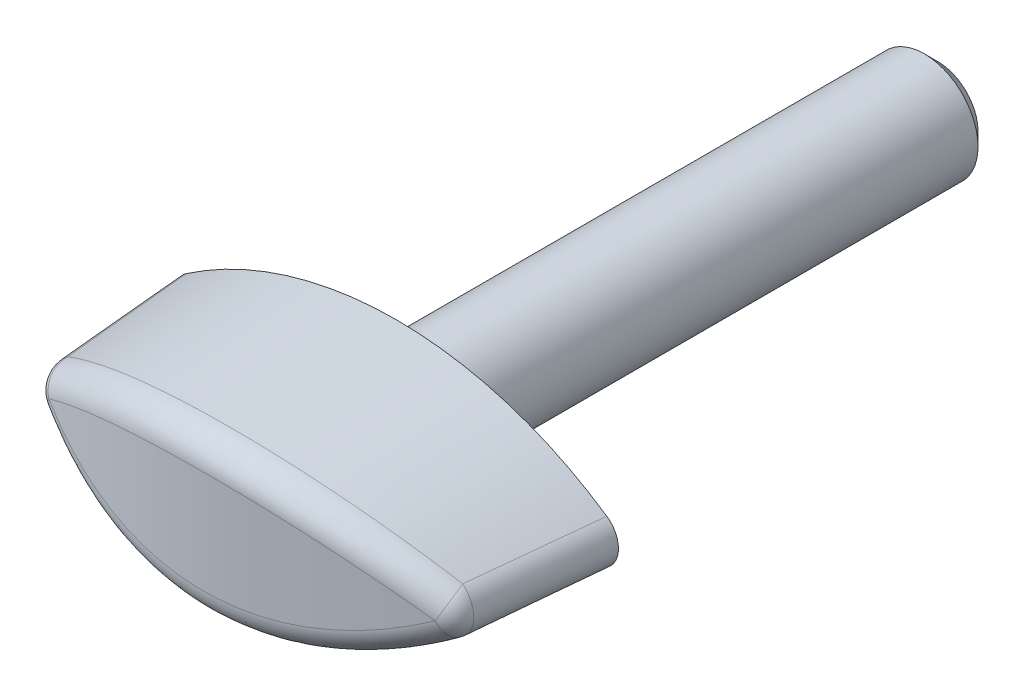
ISO-10303-21;
HEADER;
FILE_DESCRIPTION(('STEP AP214'),'2;1');
FILE_NAME('part.step','',(''),(''),'','','');
FILE_SCHEMA(('AUTOMOTIVE_DESIGN { 1 0 10303 214 1 1 1 1 }'));
ENDSEC;
DATA;
#1=APPLICATION_CONTEXT('core data for automotive mechanical design processes');
#2=APPLICATION_PROTOCOL_DEFINITION('international standard','automotive_design',2000,#1);
#3=PRODUCT_CONTEXT('',#1,'mechanical');
#4=PRODUCT('Part','Part','',(#3));
#5=PRODUCT_RELATED_PRODUCT_CATEGORY('part','',(#4));
#6=PRODUCT_DEFINITION_FORMATION('','',#4);
#7=PRODUCT_DEFINITION_CONTEXT('part definition',#1,'design');
#8=PRODUCT_DEFINITION('design','',#6,#7);
#9=PRODUCT_DEFINITION_SHAPE('','',#8);
#10=(LENGTH_UNIT() NAMED_UNIT(*) SI_UNIT(.MILLI.,.METRE.));
#11=(NAMED_UNIT(*) PLANE_ANGLE_UNIT() SI_UNIT($,.RADIAN.));
#12=(NAMED_UNIT(*) SI_UNIT($,.STERADIAN.) SOLID_ANGLE_UNIT());
#13=UNCERTAINTY_MEASURE_WITH_UNIT(LENGTH_MEASURE(1.E-05),#10,'distance_accuracy_value','');
#14=(GEOMETRIC_REPRESENTATION_CONTEXT(3) GLOBAL_UNCERTAINTY_ASSIGNED_CONTEXT((#13)) GLOBAL_UNIT_ASSIGNED_CONTEXT((#10,
#11,#12)) REPRESENTATION_CONTEXT('',''));
#15=CARTESIAN_POINT('',(0.,0.,0.));
#16=DIRECTION('',(0.,0.,1.));
#17=DIRECTION('',(1.,0.,0.));
#18=AXIS2_PLACEMENT_3D('',#15,#16,#17);
#19=CARTESIAN_POINT('',(0.,0.,2.30283251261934));
#20=DIRECTION('',(0.,0.,1.));
#21=DIRECTION('',(1.,0.,0.));
#22=AXIS2_PLACEMENT_3D('',#19,#20,#21);
#23=CYLINDRICAL_SURFACE('',#22,4.);
#24=CARTESIAN_POINT('',(0.,0.,-39.));
#25=DIRECTION('',(0.,0.,-1.));
#26=DIRECTION('',(-1.,0.,0.));
#27=AXIS2_PLACEMENT_3D('',#24,#25,#26);
#28=CIRCLE('',#27,4.);
#29=CARTESIAN_POINT('',(-4.,0.,-39.));
#30=VERTEX_POINT('',#29);
#31=EDGE_CURVE('E9',#30,#30,#28,.F.);
#32=ORIENTED_EDGE('',*,*,#31,.T.);
#33=EDGE_LOOP('',(#32));
#34=FACE_BOUND('',#33,.T.);
#35=CARTESIAN_POINT('',(0.,0.,0.));
#36=DIRECTION('',(0.,0.,1.));
#37=DIRECTION('',(1.,0.,0.));
#38=AXIS2_PLACEMENT_3D('',#35,#36,#37);
#39=CIRCLE('',#38,4.);
#40=CARTESIAN_POINT('',(4.,0.,0.));
#41=VERTEX_POINT('',#40);
#42=EDGE_CURVE('E263',#41,#41,#39,.T.);
#43=ORIENTED_EDGE('',*,*,#42,.F.);
#44=EDGE_LOOP('',(#43));
#45=FACE_BOUND('',#44,.T.);
#46=ADVANCED_FACE('F14',(#34,#45),#23,.T.);
#47=CARTESIAN_POINT('',(-0.00046056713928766,-21.3,0.402832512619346));
#48=DIRECTION('',(0.,0.,-1.));
#49=DIRECTION('',(1.,0.,0.));
#50=AXIS2_PLACEMENT_3D('',#47,#48,#49);
#51=CONICAL_SURFACE('',#50,27.8,0.05235987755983);
#52=CARTESIAN_POINT('',(-0.00046056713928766,-21.3,0.402832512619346));
#53=DIRECTION('',(0.,0.,1.));
#54=DIRECTION('',(1.,0.,0.));
#55=AXIS2_PLACEMENT_3D('',#52,#53,#54);
#56=CIRCLE('',#55,27.8);
#57=CARTESIAN_POINT('',(15.6901745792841,1.6487247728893,0.402832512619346));
#58=VERTEX_POINT('',#57);
#59=CARTESIAN_POINT('',(-15.6910957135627,1.6487247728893,0.402832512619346));
#60=VERTEX_POINT('',#59);
#61=EDGE_CURVE('E269',#58,#60,#56,.T.);
#62=ORIENTED_EDGE('',*,*,#61,.T.);
#63=CARTESIAN_POINT('',(-14.153359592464,1.70103457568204,15.5433258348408));
#64=CARTESIAN_POINT('',(-15.0967597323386,1.11474020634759,15.6376699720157));
#65=CARTESIAN_POINT('',(-15.0967597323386,0.,15.6376699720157));
#66=CARTESIAN_POINT('',(-15.0967597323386,-1.11474020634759,15.6376699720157));
#67=CARTESIAN_POINT('',(-14.153359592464,-1.70103457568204,15.5433258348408));
#68=CARTESIAN_POINT('',(-14.3318556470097,1.69502029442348,13.8560872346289));
#69=CARTESIAN_POINT('',(-15.2654012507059,1.10725885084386,13.9512591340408));
#70=CARTESIAN_POINT('',(-15.2656662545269,0.,13.9485921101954));
#71=CARTESIAN_POINT('',(-15.2654012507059,-1.10725885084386,13.9512591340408));
#72=CARTESIAN_POINT('',(-14.3318556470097,-1.69502029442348,13.8560872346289));
#73=CARTESIAN_POINT('',(-14.5077422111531,1.68906895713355,12.1686183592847));
#74=CARTESIAN_POINT('',(-15.4319944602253,1.09998107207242,12.2619062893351));
#75=CARTESIAN_POINT('',(-15.4322394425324,0.,12.2593876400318));
#76=CARTESIAN_POINT('',(-15.4319944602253,-1.09998107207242,12.2619062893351));
#77=CARTESIAN_POINT('',(-14.5077422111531,-1.68906895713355,12.1686183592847));
#78=CARTESIAN_POINT('',(-14.8547932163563,1.67728860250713,8.79328893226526));
#79=CARTESIAN_POINT('',(-15.7609233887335,1.08581921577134,8.88327985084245));
#80=CARTESIAN_POINT('',(-15.7611684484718,0.,8.8807649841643));
#81=CARTESIAN_POINT('',(-15.7609233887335,-1.08581921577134,8.88327985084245));
#82=CARTESIAN_POINT('',(-14.8547932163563,-1.67728860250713,8.79328893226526));
#83=CARTESIAN_POINT('',(-15.0259577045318,1.6714595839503,7.10542838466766));
#84=CARTESIAN_POINT('',(-15.9233017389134,1.07893267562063,7.19369848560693));
#85=CARTESIAN_POINT('',(-15.9235243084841,0.,7.19134680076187));
#86=CARTESIAN_POINT('',(-15.9233017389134,-1.07893267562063,7.19369848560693));
#87=CARTESIAN_POINT('',(-15.0259577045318,-1.6714595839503,7.10542838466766));
#88=CARTESIAN_POINT('',(-15.6389500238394,1.6505385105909,0.984561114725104));
#89=CARTESIAN_POINT('',(-16.5038593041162,1.0546564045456,1.08135142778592));
#90=CARTESIAN_POINT('',(-16.5054048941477,0.,1.0651008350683));
#91=CARTESIAN_POINT('',(-16.5038593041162,-1.0546564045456,1.08135142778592));
#92=CARTESIAN_POINT('',(-15.6389500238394,-1.6505385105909,0.984561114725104));
#93=CARTESIAN_POINT('',(-16.0683322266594,1.63579618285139,-3.44949652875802));
#94=CARTESIAN_POINT('',(-16.9125731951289,1.03822558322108,-3.35834908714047));
#95=CARTESIAN_POINT('',(-16.9138312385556,0.,-3.37233993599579));
#96=CARTESIAN_POINT('',(-16.9125731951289,-1.03822558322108,-3.35834908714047));
#97=CARTESIAN_POINT('',(-16.0683322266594,-1.63579618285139,-3.44949652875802));
#98=CARTESIAN_POINT('',(-16.9043767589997,1.60706856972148,-12.3194329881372));
#99=CARTESIAN_POINT('',(-17.7092403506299,1.00727593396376,-12.2345017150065));
#100=CARTESIAN_POINT('',(-17.7104809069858,0.,-12.2483492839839));
#101=CARTESIAN_POINT('',(-17.7092403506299,-1.00727593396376,-12.2345017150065));
#102=CARTESIAN_POINT('',(-16.9043767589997,-1.60706856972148,-12.3194329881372));
#103=CARTESIAN_POINT('',(-17.3110389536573,1.59308328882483,-16.7553118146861));
#104=CARTESIAN_POINT('',(-18.0976673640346,0.99273181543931,-16.6748115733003));
#105=CARTESIAN_POINT('',(-18.0987041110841,0.,-16.6869178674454));
#106=CARTESIAN_POINT('',(-18.0976673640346,-0.99273181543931,-16.6748115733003));
#107=CARTESIAN_POINT('',(-17.3110389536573,-1.59308328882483,-16.7553118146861));
#108=CARTESIAN_POINT('',(-18.1060525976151,1.56581345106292,-25.6287021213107));
#109=CARTESIAN_POINT('',(-18.8578714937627,0.965180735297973,-25.5531499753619));
#110=CARTESIAN_POINT('',(-18.8589022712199,0.,-25.5651900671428));
#111=CARTESIAN_POINT('',(-18.8578714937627,-0.965180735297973,-25.5531499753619));
#112=CARTESIAN_POINT('',(-18.1060525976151,-1.56581345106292,-25.6287021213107));
#113=CARTESIAN_POINT('',(-18.4944030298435,1.55252893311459,-30.0662136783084));
#114=CARTESIAN_POINT('',(-19.2300008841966,0.952156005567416,-29.9942634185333));
#115=CARTESIAN_POINT('',(-19.2308763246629,0.,-30.0048937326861));
#116=CARTESIAN_POINT('',(-19.2300008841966,-0.952156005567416,-29.9942634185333));
#117=CARTESIAN_POINT('',(-18.4944030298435,-1.55252893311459,-30.0662136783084));
#118=CARTESIAN_POINT('',(-19.0655893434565,1.53309045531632,-36.7232735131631));
#119=CARTESIAN_POINT('',(-19.7785728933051,0.933545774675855,-36.6623287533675));
#120=CARTESIAN_POINT('',(-19.778789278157,0.,-36.6649644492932));
#121=CARTESIAN_POINT('',(-19.7785728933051,-0.933545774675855,-36.6623287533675));
#122=CARTESIAN_POINT('',(-19.0655893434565,-1.53309045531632,-36.7232735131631));
#123=CARTESIAN_POINT('',(-19.2540937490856,1.52669238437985,-38.9424116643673));
#124=CARTESIAN_POINT('',(-19.959549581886,0.927505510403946,-38.8825669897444));
#125=CARTESIAN_POINT('',(-19.9597511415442,0.,-38.885060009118));
#126=CARTESIAN_POINT('',(-19.959549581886,-0.927505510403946,-38.8825669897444));
#127=CARTESIAN_POINT('',(-19.2540937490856,-1.52669238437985,-38.9424116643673));
#128=CARTESIAN_POINT('',(-19.6276330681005,1.51405317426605,-43.3809342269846));
#129=CARTESIAN_POINT('',(-20.3184015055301,0.915713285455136,-43.3229335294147));
#130=CARTESIAN_POINT('',(-20.3186020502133,0.,-43.3254160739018));
#131=CARTESIAN_POINT('',(-20.3184015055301,-0.915713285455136,-43.3229335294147));
#132=CARTESIAN_POINT('',(-19.6276330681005,-1.51405317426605,-43.3809342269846));
#133=CARTESIAN_POINT('',(-19.8126679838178,1.50781203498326,-45.6003186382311));
#134=CARTESIAN_POINT('',(-20.4963068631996,0.909959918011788,-45.5433489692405));
#135=CARTESIAN_POINT('',(-20.4964910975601,0.,-45.5456765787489));
#136=CARTESIAN_POINT('',(-20.4963068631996,-0.909959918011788,-45.5433489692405));
#137=CARTESIAN_POINT('',(-19.8126679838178,-1.50781203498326,-45.6003186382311));
#138=CARTESIAN_POINT('',(-19.9961229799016,1.50164645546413,-47.8198140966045));
#139=CARTESIAN_POINT('',(-20.6729817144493,0.904332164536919,-47.7660130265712));
#140=CARTESIAN_POINT('',(-20.6729817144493,0.,-47.7660130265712));
#141=CARTESIAN_POINT('',(-20.6729817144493,-0.904332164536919,-47.7660130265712));
#142=CARTESIAN_POINT('',(-19.9961229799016,-1.50164645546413,-47.8198140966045));
#143=(BOUNDED_SURFACE() B_SPLINE_SURFACE(3,2,((#63,#64,#65,#66,#67),(#68,#69,#70,#71,#72),(#73,
#74,#75,#76,#77),(#78,#79,#80,#81,#82),(#83,#84,#85,#86,#87),(#88,#89,#90,#91,#92),(#93,#94,#95,
#96,#97),(#98,#99,#100,#101,#102),(#103,#104,#105,#106,#107),(#108,#109,#110,#111,#112),(#113,
#114,#115,#116,#117),(#118,#119,#120,#121,#122),(#123,#124,#125,#126,#127),(#128,#129,#130,#131,
#132),(#133,#134,#135,#136,#137),(#138,#139,#140,#141,#142)),.UNSPECIFIED.,.F.,.F.,
.F.) B_SPLINE_SURFACE_WITH_KNOTS((4,2,2,2,2,2,2,4),(3,2,3),(0.,5.08695661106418,
10.1738624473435,23.5321935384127,36.8906039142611,50.2497553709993,56.9292475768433,
63.6087352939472),(0.,0.5,1.),
.UNSPECIFIED.) GEOMETRIC_REPRESENTATION_ITEM() RATIONAL_B_SPLINE_SURFACE(((1.,0.873483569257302,
1.,0.873483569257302,1.),(1.,0.874875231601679,1.,0.874875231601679,1.),(1.,0.876222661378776,
1.,0.876222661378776,1.),(1.,0.878837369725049,1.,0.878837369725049,1.),(1.,0.880104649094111,
1.,0.880104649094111,1.),(1.,0.884569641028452,1.,0.884569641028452,1.),(1.,0.887555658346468,
1.,0.887555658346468,1.),(1.,0.893140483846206,1.,0.893140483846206,1.),(1.,0.895739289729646,
1.,0.895739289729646,1.),(1.,0.90062485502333,1.,0.90062485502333,1.),(1.,0.902911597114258,1.,
0.902911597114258,1.),(1.,0.906149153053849,1.,0.906149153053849,1.),(1.,0.907196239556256,1.,
0.907196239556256,1.),(1.,0.909231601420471,1.,0.909231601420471,1.),(1.,0.910219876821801,1.,
0.910219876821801,1.),(1.,0.911181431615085,1.,0.911181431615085,1.))) REPRESENTATION_ITEM('') SURFACE());
#144=CARTESIAN_POINT('',(-19.9961229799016,1.50164645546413,-47.8198140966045));
#145=CARTESIAN_POINT('',(-19.8126679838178,1.50781203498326,-45.6003186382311));
#146=CARTESIAN_POINT('',(-19.6276330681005,1.51405317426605,-43.3809342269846));
#147=CARTESIAN_POINT('',(-19.2540937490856,1.52669238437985,-38.9424116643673));
#148=CARTESIAN_POINT('',(-19.0655893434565,1.53309045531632,-36.7232735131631));
#149=CARTESIAN_POINT('',(-18.4944030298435,1.55252893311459,-30.0662136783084));
#150=CARTESIAN_POINT('',(-18.1060525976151,1.56581345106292,-25.6287021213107));
#151=CARTESIAN_POINT('',(-17.3110389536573,1.59308328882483,-16.7553118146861));
#152=CARTESIAN_POINT('',(-16.9043767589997,1.60706856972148,-12.3194329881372));
#153=CARTESIAN_POINT('',(-16.0683322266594,1.63579618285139,-3.44949652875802));
#154=CARTESIAN_POINT('',(-15.6389500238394,1.6505385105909,0.984561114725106));
#155=CARTESIAN_POINT('',(-15.0259577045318,1.6714595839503,7.10542838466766));
#156=CARTESIAN_POINT('',(-14.8547932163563,1.67728860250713,8.79328893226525));
#157=CARTESIAN_POINT('',(-14.5077422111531,1.68906895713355,12.1686183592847));
#158=CARTESIAN_POINT('',(-14.3318556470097,1.69502029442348,13.8560872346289));
#159=CARTESIAN_POINT('',(-14.153359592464,1.70103457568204,15.5433258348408));
#160=B_SPLINE_CURVE_WITH_KNOTS('',3,(#144,#145,#146,#147,#148,#149,#150,#151,#152,#153,#154,
#155,#156,#157,#158,#159),.UNSPECIFIED.,.F.,.F.,(4,2,2,2,2,2,2,4),(0.,6.67948771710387,
13.3589799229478,26.7181313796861,40.0765417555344,53.4348728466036,58.521778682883,
63.6087352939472),.UNSPECIFIED.);
#161=CARTESIAN_POINT('',(-14.7065623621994,1.6823200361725,10.2347792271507));
#162=VERTEX_POINT('',#161);
#163=EDGE_CURVE('E183',#60,#162,#160,.T.);
#164=ORIENTED_EDGE('',*,*,#163,.T.);
#165=CARTESIAN_POINT('',(-20.0811536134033,-4.41765469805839,9.06202354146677));
#166=CARTESIAN_POINT('',(-20.794375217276,-3.4970775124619,8.6163077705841));
#167=CARTESIAN_POINT('',(-20.5149823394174,-3.09184561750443,7.47064783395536));
#168=CARTESIAN_POINT('',(-19.815137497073,-4.14625680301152,9.22826762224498));
#169=CARTESIAN_POINT('',(-20.5308171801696,-3.20305312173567,8.78928580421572));
#170=CARTESIAN_POINT('',(-20.2437516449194,-2.79870414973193,7.62808936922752));
#171=CARTESIAN_POINT('',(-19.5427558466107,-3.88016952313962,9.39387699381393));
#172=CARTESIAN_POINT('',(-20.2613659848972,-2.91519162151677,8.96138644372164));
#173=CARTESIAN_POINT('',(-19.9659982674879,-2.51127069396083,7.78492980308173));
#174=CARTESIAN_POINT('',(-18.9853591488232,-3.35883373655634,9.72289567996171));
#175=CARTESIAN_POINT('',(-19.7089688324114,-2.34984852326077,9.30413773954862));
#176=CARTESIAN_POINT('',(-19.3975413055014,-1.94806022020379,8.09652710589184));
#177=CARTESIAN_POINT('',(-18.700343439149,-3.10358579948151,9.88630487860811));
#178=CARTESIAN_POINT('',(-19.4258932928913,-2.07241226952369,9.47479653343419));
#179=CARTESIAN_POINT('',(-19.1068370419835,-1.67228381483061,8.25128386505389));
#180=CARTESIAN_POINT('',(-17.8259485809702,-2.35396683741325,10.3721355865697));
#181=CARTESIAN_POINT('',(-18.5525101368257,-1.25251492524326,9.98539122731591));
#182=CARTESIAN_POINT('',(-18.214886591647,-0.86230322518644,8.71139006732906));
#183=CARTESIAN_POINT('',(-17.2177574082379,-1.8762677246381,10.689821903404));
#184=CARTESIAN_POINT('',(-17.9443331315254,-0.729523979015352,10.3197588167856));
#185=CARTESIAN_POINT('',(-17.5943489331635,-0.346038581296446,9.01225504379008));
#186=CARTESIAN_POINT('',(-15.9491742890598,-0.965762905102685,11.3068819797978));
#187=CARTESIAN_POINT('',(-16.6701568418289,0.273374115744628,10.9732009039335));
#188=CARTESIAN_POINT('',(-16.2997263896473,0.638135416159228,9.59664208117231));
#189=CARTESIAN_POINT('',(-15.2884707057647,-0.533266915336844,11.6061242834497));
#190=CARTESIAN_POINT('',(-16.0031357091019,0.752117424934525,11.2918009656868));
#191=CARTESIAN_POINT('',(-15.6253216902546,1.1057110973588,9.88003964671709));
#192=CARTESIAN_POINT('',(-13.9208675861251,0.279150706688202,12.1765559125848));
#193=CARTESIAN_POINT('',(-14.6152521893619,1.65761638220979,11.9033901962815));
#194=CARTESIAN_POINT('',(-14.2290764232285,1.98415563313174,10.4202671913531));
#195=CARTESIAN_POINT('',(-13.2139942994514,0.659101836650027,12.4477609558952));
#196=CARTESIAN_POINT('',(-13.8940627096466,2.08328537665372,12.1957872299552));
#197=CARTESIAN_POINT('',(-13.5072628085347,2.3950563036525,10.6771120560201));
#198=CARTESIAN_POINT('',(-11.9037976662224,1.29127459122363,12.9040328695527));
#199=CARTESIAN_POINT('',(-12.5513754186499,2.79582931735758,12.6907809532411));
#200=CARTESIAN_POINT('',(-12.169137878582,3.07881265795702,11.1092245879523));
#201=CARTESIAN_POINT('',(-11.3082180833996,1.55381959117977,13.0954566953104));
#202=CARTESIAN_POINT('',(-11.937530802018,3.09343963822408,12.8996952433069));
#203=CARTESIAN_POINT('',(-11.5607814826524,3.36281474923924,11.2905126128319));
#204=CARTESIAN_POINT('',(-10.0920972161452,2.03992330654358,13.4523500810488));
#205=CARTESIAN_POINT('',(-10.6779261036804,3.64779713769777,13.2916186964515));
#206=CARTESIAN_POINT('',(-10.3184198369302,3.88869405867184,11.6285086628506));
#207=CARTESIAN_POINT('',(-9.47156072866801,2.26348947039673,13.61782459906));
#208=CARTESIAN_POINT('',(-10.0325856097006,3.90376958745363,13.4741122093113));
#209=CARTESIAN_POINT('',(-9.68441951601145,4.13057932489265,11.7852213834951));
#210=CARTESIAN_POINT('',(-8.21085725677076,2.66837293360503,13.9189969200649));
#211=CARTESIAN_POINT('',(-8.71506821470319,4.37008842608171,13.8082918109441));
#212=CARTESIAN_POINT('',(-8.39623064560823,4.56867140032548,12.0704467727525));
#213=CARTESIAN_POINT('',(-7.57076855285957,2.84983870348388,14.0547992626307));
#214=CARTESIAN_POINT('',(-8.04373214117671,4.57980517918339,13.9595380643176));
#215=CARTESIAN_POINT('',(-7.74212254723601,4.76503873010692,12.1990584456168));
#216=CARTESIAN_POINT('',(-6.27276490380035,3.16913872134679,14.294446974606));
#217=CARTESIAN_POINT('',(-6.67611405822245,4.95084987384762,14.2279730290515));
#218=CARTESIAN_POINT('',(-6.41558263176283,5.1105777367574,12.42601692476));
#219=CARTESIAN_POINT('',(-5.6148541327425,3.30698309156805,14.3982997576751));
#220=CARTESIAN_POINT('',(-5.98095824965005,5.11144433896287,14.3446384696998));
#221=CARTESIAN_POINT('',(-5.74315510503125,5.25976036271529,12.524370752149));
#222=CARTESIAN_POINT('',(-4.469550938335,3.50526400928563,14.5477369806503));
#223=CARTESIAN_POINT('',(-4.76699841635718,5.34334265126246,14.513216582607));
#224=CARTESIAN_POINT('',(-4.57251302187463,5.47435769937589,12.6658953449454));
#225=CARTESIAN_POINT('',(-3.98527879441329,3.57656511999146,14.6014927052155));
#226=CARTESIAN_POINT('',(-4.25248577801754,5.42691580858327,14.5740114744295));
#227=CARTESIAN_POINT('',(-4.07750634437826,5.55152868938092,12.7168047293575));
#228=CARTESIAN_POINT('',(-3.01174289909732,3.69472517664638,14.6903879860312));
#229=CARTESIAN_POINT('',(-3.21589634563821,5.56575349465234,14.6748365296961));
#230=CARTESIAN_POINT('',(-3.08236136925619,5.67941760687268,12.8009930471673));
#231=CARTESIAN_POINT('',(-2.52247966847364,3.74158664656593,14.7255294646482));
#232=CARTESIAN_POINT('',(-2.69445046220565,5.62084543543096,14.7147407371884));
#233=CARTESIAN_POINT('',(-2.58222360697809,5.7301382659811,12.8342738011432));
#234=CARTESIAN_POINT('',(-1.54056281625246,3.81050009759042,14.7767608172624));
#235=CARTESIAN_POINT('',(-1.64628256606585,5.70198847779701,14.7730659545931));
#236=CARTESIAN_POINT('',(-1.57846523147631,5.80472574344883,12.8827924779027));
#237=CARTESIAN_POINT('',(-1.04790652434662,3.83252956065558,14.7928333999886));
#238=CARTESIAN_POINT('',(-1.12024397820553,5.72790625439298,14.7913894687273));
#239=CARTESIAN_POINT('',(-1.07484187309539,5.82856818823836,12.8980140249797));
#240=CARTESIAN_POINT('',(-0.0619125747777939,3.85152073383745,14.805659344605));
#241=CARTESIAN_POINT('',(-0.0664657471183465,5.75020151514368,14.8061034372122));
#242=CARTESIAN_POINT('',(-0.0668941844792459,5.84911822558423,12.9101608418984));
#243=CARTESIAN_POINT('',(0.431424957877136,3.84848655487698,14.8024158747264));
#244=CARTESIAN_POINT('',(0.460560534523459,5.74655453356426,14.8024769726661));
#245=CARTESIAN_POINT('',(0.437430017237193,5.84583026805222,12.9070891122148));
#246=CARTESIAN_POINT('',(1.60255721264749,3.81150451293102,14.7717686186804));
#247=CARTESIAN_POINT('',(1.71175123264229,5.70275305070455,14.7677795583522));
#248=CARTESIAN_POINT('',(1.63463358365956,5.80579033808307,12.8780646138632));
#249=CARTESIAN_POINT('',(2.27978109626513,3.76633440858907,14.7357181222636));
#250=CARTESIAN_POINT('',(2.43402260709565,5.64946733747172,14.7269642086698));
#251=CARTESIAN_POINT('',(2.32692566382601,5.75689079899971,12.8439229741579));
#252=CARTESIAN_POINT('',(3.62612133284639,3.6292355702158,14.6278577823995));
#253=CARTESIAN_POINT('',(3.86899032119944,5.48787530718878,14.6048083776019));
#254=CARTESIAN_POINT('',(3.70317371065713,5.60848345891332,12.7417737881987));
#255=CARTESIAN_POINT('',(4.295235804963,3.53729619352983,14.5560397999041));
#256=CARTESIAN_POINT('',(4.57997445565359,5.37995560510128,14.5237564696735));
#257=CARTESIAN_POINT('',(4.38712774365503,5.50896413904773,12.6737585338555));
#258=CARTESIAN_POINT('',(5.620453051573,3.30807293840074,14.3782886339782));
#259=CARTESIAN_POINT('',(5.98551056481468,5.11135398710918,14.323447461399));
#260=CARTESIAN_POINT('',(5.74165729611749,5.26085961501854,12.5054192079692));
#261=CARTESIAN_POINT('',(6.27654930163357,3.17076690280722,14.2723387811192));
#262=CARTESIAN_POINT('',(6.67861072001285,4.95125521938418,14.2046189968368));
#263=CARTESIAN_POINT('',(6.41222610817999,5.11225043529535,12.4050793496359));
#264=CARTESIAN_POINT('',(7.57081563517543,2.85284943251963,14.0287113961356));
#265=CARTESIAN_POINT('',(8.04198725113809,4.58157504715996,13.9321193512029));
#266=CARTESIAN_POINT('',(7.73493729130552,4.76818970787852,12.1743519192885));
#267=CARTESIAN_POINT('',(8.20898646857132,2.67223981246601,13.8910351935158));
#268=CARTESIAN_POINT('',(8.71115884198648,4.37273579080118,13.7789822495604));
#269=CARTESIAN_POINT('',(8.38708043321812,4.57274012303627,12.0439656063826));
#270=CARTESIAN_POINT('',(9.45972662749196,2.27134461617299,13.5877932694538));
#271=CARTESIAN_POINT('',(10.018010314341,3.91078956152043,13.4428892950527));
#272=CARTESIAN_POINT('',(9.66507796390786,4.13894650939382,11.7567801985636));
#273=CARTESIAN_POINT('',(10.0724307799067,2.05131346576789,13.4224068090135));
#274=CARTESIAN_POINT('',(10.6550893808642,3.6587567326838,13.2606777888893));
#275=CARTESIAN_POINT('',(10.2910709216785,3.90087755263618,11.600150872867));
#276=CARTESIAN_POINT('',(11.2734423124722,1.57331508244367,13.0663341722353));
#277=CARTESIAN_POINT('',(11.8988735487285,3.11342074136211,12.870007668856));
#278=CARTESIAN_POINT('',(11.5179880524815,3.38374983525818,11.2629321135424));
#279=CARTESIAN_POINT('',(11.861749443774,1.31534746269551,12.8756477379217));
#280=CARTESIAN_POINT('',(12.5051806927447,2.82087015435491,12.6620530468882));
#281=CARTESIAN_POINT('',(12.1189119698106,3.10469065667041,11.0823424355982));
#282=CARTESIAN_POINT('',(13.0124178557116,0.763585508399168,12.4721015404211));
#283=CARTESIAN_POINT('',(13.6860353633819,2.19779571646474,12.2239210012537));
#284=CARTESIAN_POINT('',(13.2941017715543,2.50788863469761,10.7001638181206));
#285=CARTESIAN_POINT('',(13.5747438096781,0.469744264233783,12.259212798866));
#286=CARTESIAN_POINT('',(14.2604369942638,1.86790212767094,11.9941414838));
#287=CARTESIAN_POINT('',(13.8683313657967,2.19009514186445,10.4985474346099));
#288=CARTESIAN_POINT('',(14.6709415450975,-0.151187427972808,11.8149774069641));
#289=CARTESIAN_POINT('',(15.3754021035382,1.17378101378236,11.5168362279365));
#290=CARTESIAN_POINT('',(14.9875696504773,1.51863734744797,10.0778340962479));
#291=CARTESIAN_POINT('',(15.2048097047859,-0.478282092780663,11.5836284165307));
#292=CARTESIAN_POINT('',(15.9160811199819,0.810131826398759,11.2696393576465));
#293=CARTESIAN_POINT('',(15.5325746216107,1.16496849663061,9.85873492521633));
#294=CARTESIAN_POINT('',(16.3010347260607,-1.2020925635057,11.0792697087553));
#295=CARTESIAN_POINT('',(17.0209453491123,0.00934023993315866,10.7334934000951));
#296=CARTESIAN_POINT('',(16.6514893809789,0.382463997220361,9.38108177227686));
#297=CARTESIAN_POINT('',(16.859863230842,-1.60250195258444,10.8044985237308));
#298=CARTESIAN_POINT('',(17.5821760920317,-0.431467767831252,10.4428567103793));
#299=CARTESIAN_POINT('',(17.2217772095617,-0.0503529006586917,9.12085959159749));
#300=CARTESIAN_POINT('',(17.93940530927,-2.43944703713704,10.241618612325));
#301=CARTESIAN_POINT('',(18.6616083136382,-1.34884391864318,9.85027402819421));
#302=CARTESIAN_POINT('',(18.3232481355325,-0.954885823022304,8.5877839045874));
#303=CARTESIAN_POINT('',(18.4601120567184,-2.87598917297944,9.95350751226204));
#304=CARTESIAN_POINT('',(19.1803900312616,-1.82496232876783,9.54846485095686));
#305=CARTESIAN_POINT('',(18.8544242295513,-1.42660878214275,8.31492815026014));
#306=CARTESIAN_POINT('',(19.4601451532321,-3.78132024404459,9.37044845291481));
#307=CARTESIAN_POINT('',(20.172691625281,-2.80841975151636,8.94035828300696));
#308=CARTESIAN_POINT('',(19.8743614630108,-2.40473038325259,7.76274179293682));
#309=CARTESIAN_POINT('',(19.9396415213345,-4.2499607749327,9.07553565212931));
#310=CARTESIAN_POINT('',(20.647062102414,-3.31530887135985,8.63408727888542));
#311=CARTESIAN_POINT('',(20.3632969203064,-2.91096939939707,7.48344448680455));
#312=CARTESIAN_POINT('',(20.6287720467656,-4.97711707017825,8.63137956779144));
#313=CARTESIAN_POINT('',(21.3283507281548,-4.10131871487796,8.173304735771));
#314=CARTESIAN_POINT('',(21.0658500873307,-3.69632587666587,7.06280625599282));
#315=CARTESIAN_POINT('',(20.8534327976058,-5.22349757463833,8.4830513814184));
#316=CARTESIAN_POINT('',(21.5494719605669,-4.36633664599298,8.02017946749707));
#317=CARTESIAN_POINT('',(21.2948618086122,-3.96240386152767,6.92233197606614));
#318=CARTESIAN_POINT('',(21.2926427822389,-5.72427052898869,8.18649529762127));
#319=CARTESIAN_POINT('',(21.9810585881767,-4.904043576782,7.71461878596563));
#320=CARTESIAN_POINT('',(21.7425310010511,-4.50316520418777,6.6414783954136));
#321=CARTESIAN_POINT('',(21.507191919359,-5.97866305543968,8.03826740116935));
#322=CARTESIAN_POINT('',(22.1916197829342,-5.17672868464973,7.56215587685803));
#323=CARTESIAN_POINT('',(21.9611883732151,-4.77784864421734,6.50109909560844));
#324=CARTESIAN_POINT('',(21.7166323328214,-6.23702325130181,7.89044601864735));
#325=CARTESIAN_POINT('',(22.3974453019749,-5.45401421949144,7.40994062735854));
#326=CARTESIAN_POINT('',(22.1746166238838,-5.05679182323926,6.36110478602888));
#327=(BOUNDED_SURFACE() B_SPLINE_SURFACE(3,2,((#165,#166,#167),(#168,#169,#170),(#171,#172,
#173),(#174,#175,#176),(#177,#178,#179),(#180,#181,#182),(#183,#184,#185),(#186,#187,#188),
(#189,#190,#191),(#192,#193,#194),(#195,#196,#197),(#198,#199,#200),(#201,#202,#203),(#204,#205,
#206),(#207,#208,#209),(#210,#211,#212),(#213,#214,#215),(#216,#217,#218),(#219,#220,#221),
(#222,#223,#224),(#225,#226,#227),(#228,#229,#230),(#231,#232,#233),(#234,#235,#236),(#237,#238,
#239),(#240,#241,#242),(#243,#244,#245),(#246,#247,#248),(#249,#250,#251),(#252,#253,#254),
(#255,#256,#257),(#258,#259,#260),(#261,#262,#263),(#264,#265,#266),(#267,#268,#269),(#270,#271,
#272),(#273,#274,#275),(#276,#277,#278),(#279,#280,#281),(#282,#283,#284),(#285,#286,#287),
(#288,#289,#290),(#291,#292,#293),(#294,#295,#296),(#297,#298,#299),(#300,#301,#302),(#303,#304,
#305),(#306,#307,#308),(#309,#310,#311),(#312,#313,#314),(#315,#316,#317),(#318,#319,#320),
(#321,#322,#323),(#324,#325,#326)),.UNSPECIFIED.,.F.,.F.,.F.) B_SPLINE_SURFACE_WITH_KNOTS((4,2,
2,2,2,2,2,2,2,2,2,2,2,2,2,2,2,2,2,2,2,2,2,2,2,2,4),(3,3),(0.,1.20698527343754,2.41403389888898,
4.8305598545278,7.26268570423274,9.6934406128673,11.6356284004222,13.5774446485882,
15.5123051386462,17.4467163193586,18.8465647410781,20.2462685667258,21.6472406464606,
23.0479829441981,24.9767574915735,26.9059711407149,28.8361284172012,30.7662048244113,
32.6842460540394,34.6023068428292,36.522903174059,38.4437433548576,40.580186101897,
42.7170104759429,44.844547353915,45.9080071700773,46.9714771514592),(0.,1.),
.UNSPECIFIED.) GEOMETRIC_REPRESENTATION_ITEM() RATIONAL_B_SPLINE_SURFACE(((1.,0.848585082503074,
1.),(1.,0.845596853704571,1.),(1.,0.842576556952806,1.),(1.,0.836489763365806,1.),(1.,
0.833423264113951,1.),(1.,0.82417564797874,1.),(1.,0.817952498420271,1.),(1.,0.805532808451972,
1.),(1.,0.79933669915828,1.),(1.,0.787223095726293,1.),(1.,0.781305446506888,1.),(1.,
0.771122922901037,1.),(1.,0.766764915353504,1.),(1.,0.758508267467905,1.),(1.,0.754609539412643,
1.),(1.,0.747416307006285,1.),(1.,0.744119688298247,1.),(1.,0.738238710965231,1.),(1.,
0.735654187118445,1.),(1.,0.731904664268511,1.),(1.,0.730544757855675,1.),(1.,0.728284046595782,
1.),(1.,0.727383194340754,1.),(1.,0.72606162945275,1.),(1.,0.72564135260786,1.),(1.,
0.725292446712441,1.),(1.,0.725363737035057,1.),(1.,0.726116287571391,1.),(1.,0.727017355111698,
1.),(1.,0.729709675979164,1.),(1.,0.731501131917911,1.),(1.,0.735896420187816,1.),(1.,
0.738500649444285,1.),(1.,0.74441421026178,1.),(1.,0.747723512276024,1.),(1.,0.754900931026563,
1.),(1.,0.75876543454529,1.),(1.,0.766940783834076,1.),(1.,0.771251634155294,1.),(1.,
0.780199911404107,1.),(1.,0.784837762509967,1.),(1.,0.794317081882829,1.),(1.,0.799158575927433,
1.),(1.,0.809486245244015,1.),(1.,0.814983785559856,1.),(1.,0.825966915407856,1.),(1.,
0.831452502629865,1.),(1.,0.842274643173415,1.),(1.,0.847611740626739,1.),(1.,0.855448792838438,
1.),(1.,0.858032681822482,1.),(1.,0.863134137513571,1.),(1.,0.865651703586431,1.),(1.,
0.868130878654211,1.))) REPRESENTATION_ITEM('') SURFACE());
#328=CARTESIAN_POINT('',(-20.5149823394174,-3.09184561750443,7.47064783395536));
#329=CARTESIAN_POINT('',(-20.2437516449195,-2.79870414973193,7.62808936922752));
#330=CARTESIAN_POINT('',(-19.9659982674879,-2.51127069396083,7.78492980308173));
#331=CARTESIAN_POINT('',(-19.3975413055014,-1.94806022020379,8.09652710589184));
#332=CARTESIAN_POINT('',(-19.1068370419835,-1.67228381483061,8.25128386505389));
#333=CARTESIAN_POINT('',(-18.214886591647,-0.86230322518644,8.71139006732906));
#334=CARTESIAN_POINT('',(-17.5943489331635,-0.346038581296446,9.01225504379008));
#335=CARTESIAN_POINT('',(-16.2997263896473,0.638135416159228,9.59664208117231));
#336=CARTESIAN_POINT('',(-15.6253216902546,1.1057110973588,9.88003964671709));
#337=CARTESIAN_POINT('',(-14.2290764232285,1.98415563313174,10.4202671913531));
#338=CARTESIAN_POINT('',(-13.5072628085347,2.3950563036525,10.6771120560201));
#339=CARTESIAN_POINT('',(-12.169137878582,3.07881265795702,11.1092245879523));
#340=CARTESIAN_POINT('',(-11.5607814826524,3.36281474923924,11.2905126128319));
#341=CARTESIAN_POINT('',(-10.3184198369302,3.88869405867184,11.6285086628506));
#342=CARTESIAN_POINT('',(-9.68441951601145,4.13057932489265,11.7852213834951));
#343=CARTESIAN_POINT('',(-8.39623064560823,4.56867140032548,12.0704467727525));
#344=CARTESIAN_POINT('',(-7.74212254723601,4.76503873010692,12.1990584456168));
#345=CARTESIAN_POINT('',(-6.41558263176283,5.1105777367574,12.42601692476));
#346=CARTESIAN_POINT('',(-5.74315510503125,5.25976036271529,12.524370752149));
#347=CARTESIAN_POINT('',(-4.57251302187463,5.47435769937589,12.6658953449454));
#348=CARTESIAN_POINT('',(-4.07750634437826,5.55152868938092,12.7168047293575));
#349=CARTESIAN_POINT('',(-3.08236136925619,5.67941760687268,12.8009930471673));
#350=CARTESIAN_POINT('',(-2.58222360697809,5.7301382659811,12.8342738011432));
#351=CARTESIAN_POINT('',(-1.57846523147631,5.80472574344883,12.8827924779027));
#352=CARTESIAN_POINT('',(-1.07484187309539,5.82856818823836,12.8980140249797));
#353=CARTESIAN_POINT('',(-0.0668941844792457,5.84911822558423,12.9101608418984));
#354=CARTESIAN_POINT('',(0.437430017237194,5.84583026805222,12.9070891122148));
#355=CARTESIAN_POINT('',(1.63463358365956,5.80579033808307,12.8780646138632));
#356=CARTESIAN_POINT('',(2.326925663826,5.75689079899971,12.8439229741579));
#357=CARTESIAN_POINT('',(3.70317371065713,5.60848345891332,12.7417737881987));
#358=CARTESIAN_POINT('',(4.38712774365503,5.50896413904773,12.6737585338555));
#359=CARTESIAN_POINT('',(5.74165729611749,5.26085961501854,12.5054192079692));
#360=CARTESIAN_POINT('',(6.41222610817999,5.11225043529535,12.4050793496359));
#361=CARTESIAN_POINT('',(7.73493729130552,4.76818970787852,12.1743519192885));
#362=CARTESIAN_POINT('',(8.38708043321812,4.57274012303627,12.0439656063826));
#363=CARTESIAN_POINT('',(9.66507796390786,4.13894650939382,11.7567801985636));
#364=CARTESIAN_POINT('',(10.2910709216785,3.90087755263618,11.600150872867));
#365=CARTESIAN_POINT('',(11.5179880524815,3.38374983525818,11.2629321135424));
#366=CARTESIAN_POINT('',(12.1189119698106,3.10469065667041,11.0823424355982));
#367=CARTESIAN_POINT('',(13.2941017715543,2.50788863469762,10.7001638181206));
#368=CARTESIAN_POINT('',(13.8683313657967,2.19009514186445,10.4985474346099));
#369=CARTESIAN_POINT('',(14.9875696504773,1.51863734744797,10.0778340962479));
#370=CARTESIAN_POINT('',(15.5325746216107,1.16496849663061,9.85873492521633));
#371=CARTESIAN_POINT('',(16.6514893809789,0.382463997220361,9.38108177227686));
#372=CARTESIAN_POINT('',(17.2217772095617,-0.0503529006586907,9.12085959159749));
#373=CARTESIAN_POINT('',(18.3232481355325,-0.954885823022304,8.5877839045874));
#374=CARTESIAN_POINT('',(18.8544242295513,-1.42660878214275,8.31492815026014));
#375=CARTESIAN_POINT('',(19.8743614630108,-2.40473038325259,7.76274179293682));
#376=CARTESIAN_POINT('',(20.3632969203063,-2.91096939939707,7.48344448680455));
#377=CARTESIAN_POINT('',(21.0658500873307,-3.69632587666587,7.06280625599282));
#378=CARTESIAN_POINT('',(21.2948618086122,-3.96240386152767,6.92233197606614));
#379=CARTESIAN_POINT('',(21.7425310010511,-4.50316520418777,6.6414783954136));
#380=CARTESIAN_POINT('',(21.9611883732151,-4.77784864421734,6.50109909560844));
#381=CARTESIAN_POINT('',(22.1746166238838,-5.05679182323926,6.36110478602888));
#382=B_SPLINE_CURVE_WITH_KNOTS('',3,(#328,#329,#330,#331,#332,#333,#334,#335,#336,#337,#338,
#339,#340,#341,#342,#343,#344,#345,#346,#347,#348,#349,#350,#351,#352,#353,#354,#355,#356,#357,
#358,#359,#360,#361,#362,#363,#364,#365,#366,#367,#368,#369,#370,#371,#372,#373,#374,#375,#376,
#377,#378,#379,#380,#381),.UNSPECIFIED.,.F.,.F.,(4,2,2,2,2,2,2,2,2,2,2,2,2,2,2,2,2,2,2,2,2,2,2,
2,2,2,4),(0.,1.20698527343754,2.41403389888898,4.8305598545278,7.26268570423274,9.6934406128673,
11.6356284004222,13.5774446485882,15.5123051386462,17.4467163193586,18.8465647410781,
20.2462685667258,21.6472406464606,23.0479829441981,24.9767574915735,26.9059711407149,
28.8361284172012,30.7662048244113,32.6842460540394,34.6023068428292,36.522903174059,
38.4437433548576,40.580186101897,42.7170104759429,44.844547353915,45.9080071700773,
46.9714771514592),.UNSPECIFIED.);
#383=CARTESIAN_POINT('',(14.7112145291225,1.68213078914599,10.1804943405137));
#384=VERTEX_POINT('',#383);
#385=EDGE_CURVE('E67',#162,#384,#382,.T.);
#386=ORIENTED_EDGE('',*,*,#385,.T.);
#387=CARTESIAN_POINT('',(14.1562950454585,-1.70090463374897,15.5068693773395));
#388=CARTESIAN_POINT('',(15.0994880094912,-1.11457832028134,15.6011737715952));
#389=CARTESIAN_POINT('',(15.0994880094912,0.,15.6011737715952));
#390=CARTESIAN_POINT('',(15.0994880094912,1.11457832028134,15.6011737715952));
#391=CARTESIAN_POINT('',(14.1562950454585,1.70090463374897,15.5068693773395));
#392=CARTESIAN_POINT('',(14.3346959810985,-1.69489318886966,13.8201688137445));
#393=CARTESIAN_POINT('',(15.2680418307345,-1.10710248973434,13.9153000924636));
#394=CARTESIAN_POINT('',(15.2683064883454,0.,13.9126360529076));
#395=CARTESIAN_POINT('',(15.2680418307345,1.10710248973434,13.9153000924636));
#396=CARTESIAN_POINT('',(14.3346959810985,1.69489318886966,13.8201688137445));
#397=CARTESIAN_POINT('',(14.5104911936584,-1.68894463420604,12.1332383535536));
#398=CARTESIAN_POINT('',(15.4345503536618,-1.09982994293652,12.2264878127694));
#399=CARTESIAN_POINT('',(15.4347950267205,0.,12.2239719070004));
#400=CARTESIAN_POINT('',(15.4345503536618,1.09982994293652,12.2264878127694));
#401=CARTESIAN_POINT('',(14.5104911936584,1.68894463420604,12.1332383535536));
#402=CARTESIAN_POINT('',(14.8573660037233,-1.67716974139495,8.75898636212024));
#403=CARTESIAN_POINT('',(15.7633158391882,-1.08567800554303,8.84894229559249));
#404=CARTESIAN_POINT('',(15.7635605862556,0.,8.84643018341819));
#405=CARTESIAN_POINT('',(15.7633158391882,1.08567800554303,8.84894229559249));
#406=CARTESIAN_POINT('',(14.8573660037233,1.67716974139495,8.75898636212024));
#407=CARTESIAN_POINT('',(15.0284456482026,-1.67134340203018,7.07166483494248));
#408=CARTESIAN_POINT('',(15.9256153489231,-1.07879615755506,7.15990181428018));
#409=CARTESIAN_POINT('',(15.9258376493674,0.,7.15755260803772));
#410=CARTESIAN_POINT('',(15.9256153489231,1.07879615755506,7.15990181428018));
#411=CARTESIAN_POINT('',(15.0284456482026,1.67134340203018,7.07166483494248));
#412=CARTESIAN_POINT('',(15.6412826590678,-1.65042700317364,0.951330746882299));
#413=CARTESIAN_POINT('',(16.5060318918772,-1.05453037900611,1.04808780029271));
#414=CARTESIAN_POINT('',(16.5075766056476,0.,1.0318438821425));
#415=CARTESIAN_POINT('',(16.5060318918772,1.05453037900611,1.04808780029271));
#416=CARTESIAN_POINT('',(15.6412826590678,1.65042700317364,0.951330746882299));
#417=CARTESIAN_POINT('',(16.0706012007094,-1.63568664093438,-3.48273199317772));
#418=CARTESIAN_POINT('',(16.914688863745,-1.03810484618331,-3.39161430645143));
#419=CARTESIAN_POINT('',(16.9159462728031,0.,-3.40559991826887));
#420=CARTESIAN_POINT('',(16.914688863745,1.03810484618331,-3.39161430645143));
#421=CARTESIAN_POINT('',(16.0706012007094,1.63568664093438,-3.48273199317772));
#422=CARTESIAN_POINT('',(16.9065313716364,-1.60696281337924,-12.3526773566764));
#423=CARTESIAN_POINT('',(17.7112542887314,-1.00716466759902,-12.2677721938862));
#424=CARTESIAN_POINT('',(17.7124942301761,0.,-12.2816146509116));
#425=CARTESIAN_POINT('',(17.7112542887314,1.00716466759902,-12.2677721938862));
#426=CARTESIAN_POINT('',(16.9065313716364,1.60696281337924,-12.3526773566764));
#427=CARTESIAN_POINT('',(17.3131428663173,-1.5929793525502,-16.7885599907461));
#428=CARTESIAN_POINT('',(18.0996361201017,-0.992624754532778,-16.7080834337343));
#429=CARTESIAN_POINT('',(18.1006724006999,0.,-16.7201855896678));
#430=CARTESIAN_POINT('',(18.0996361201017,0.992624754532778,-16.7080834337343));
#431=CARTESIAN_POINT('',(17.3131428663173,1.5929793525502,-16.7885599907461));
#432=CARTESIAN_POINT('',(18.1080644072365,-1.56571302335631,-25.6619567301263));
#433=CARTESIAN_POINT('',(18.859758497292,-0.965081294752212,-25.5864257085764));
#434=CARTESIAN_POINT('',(18.8607888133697,0.,-25.5984617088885));
#435=CARTESIAN_POINT('',(18.859758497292,0.965081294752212,-25.5864257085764));
#436=CARTESIAN_POINT('',(18.1080644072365,1.56571302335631,-25.6619567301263));
#437=CARTESIAN_POINT('',(18.4963734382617,-1.55243019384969,-30.0994709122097));
#438=CARTESIAN_POINT('',(19.2318510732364,-0.9520599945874,-30.0275399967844));
#439=CARTESIAN_POINT('',(19.2327261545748,0.,-30.0381669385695));
#440=CARTESIAN_POINT('',(19.2318510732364,0.9520599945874,-30.0275399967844));
#441=CARTESIAN_POINT('',(18.4963734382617,1.55243019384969,-30.0994709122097));
#442=CARTESIAN_POINT('',(19.0675028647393,-1.53299415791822,-36.7565342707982));
#443=CARTESIAN_POINT('',(19.7803723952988,-0.933454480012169,-36.695604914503));
#444=CARTESIAN_POINT('',(19.7805886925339,0.,-36.6982397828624));
#445=CARTESIAN_POINT('',(19.7803723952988,0.933454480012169,-36.695604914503));
#446=CARTESIAN_POINT('',(19.0675028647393,1.53299415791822,-36.7565342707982));
#447=CARTESIAN_POINT('',(19.2559891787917,-1.52659688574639,-38.9756735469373));
#448=CARTESIAN_POINT('',(19.9613330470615,-0.927415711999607,-38.9158437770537));
#449=CARTESIAN_POINT('',(19.961534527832,0.,-38.9183360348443));
#450=CARTESIAN_POINT('',(19.9613330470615,0.927415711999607,-38.9158437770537));
#451=CARTESIAN_POINT('',(19.2559891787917,1.52659688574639,-38.9756735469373));
#452=CARTESIAN_POINT('',(19.6294938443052,-1.51395924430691,-43.4141982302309));
#453=CARTESIAN_POINT('',(20.3201542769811,-0.915626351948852,-43.3562116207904));
#454=CARTESIAN_POINT('',(20.3203547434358,0.,-43.3586934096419));
#455=CARTESIAN_POINT('',(20.3201542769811,0.915626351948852,-43.3562116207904));
#456=CARTESIAN_POINT('',(19.6294938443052,1.51395924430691,-43.4141982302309));
#457=CARTESIAN_POINT('',(19.814512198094,-1.50771887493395,-45.6335836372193));
#458=CARTESIAN_POINT('',(20.4980449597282,-0.909874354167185,-45.576627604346));
#459=CARTESIAN_POINT('',(20.498229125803,0.,-45.5789545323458));
#460=CARTESIAN_POINT('',(20.4980449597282,0.909874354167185,-45.576627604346));
#461=CARTESIAN_POINT('',(19.814512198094,1.50771887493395,-45.6335836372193));
#462=CARTESIAN_POINT('',(19.9979512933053,-1.50155405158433,-47.8530800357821));
#463=CARTESIAN_POINT('',(20.6747056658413,-0.904247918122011,-47.7992915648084));
#464=CARTESIAN_POINT('',(20.6747056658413,0.,-47.7992915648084));
#465=CARTESIAN_POINT('',(20.6747056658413,0.904247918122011,-47.7992915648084));
#466=CARTESIAN_POINT('',(19.9979512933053,1.50155405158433,-47.8530800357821));
#467=(BOUNDED_SURFACE() B_SPLINE_SURFACE(3,2,((#387,#388,#389,#390,#391),(#392,#393,#394,#395,
#396),(#397,#398,#399,#400,#401),(#402,#403,#404,#405,#406),(#407,#408,#409,#410,#411),(#412,
#413,#414,#415,#416),(#417,#418,#419,#420,#421),(#422,#423,#424,#425,#426),(#427,#428,#429,#430,
#431),(#432,#433,#434,#435,#436),(#437,#438,#439,#440,#441),(#442,#443,#444,#445,#446),(#447,
#448,#449,#450,#451),(#452,#453,#454,#455,#456),(#457,#458,#459,#460,#461),(#462,#463,#464,#465,
#466)),.UNSPECIFIED.,.F.,.F.,.F.) B_SPLINE_SURFACE_WITH_KNOTS((4,2,2,2,2,2,2,4),(3,2,3),(0.,
5.08532431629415,10.1705979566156,23.5289288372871,36.8873388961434,50.2464890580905,
56.9259807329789,63.6054679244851),(0.,0.5,1.),
.UNSPECIFIED.) GEOMETRIC_REPRESENTATION_ITEM() RATIONAL_B_SPLINE_SURFACE(((1.,0.873513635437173,
1.,0.873513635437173,1.),(1.,0.874904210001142,1.,0.874904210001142,1.),(1.,0.876250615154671,
1.,0.876250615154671,1.),(1.,0.878863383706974,1.,0.878863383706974,1.),(1.,0.880129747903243,
1.,0.880129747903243,1.),(1.,0.884592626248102,1.,0.884592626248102,1.),(1.,0.887577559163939,
1.,0.887577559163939,1.),(1.,0.893160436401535,1.,0.893160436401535,1.),(1.,0.89575837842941,1.,
0.89575837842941,1.),(1.,0.90064237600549,1.,0.90064237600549,1.),(1.,0.902928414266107,1.,
0.902928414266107,1.),(1.,0.906165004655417,1.,0.906165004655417,1.),(1.,0.907211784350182,1.,
0.907211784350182,1.),(1.,0.90924655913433,1.,0.90924655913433,1.),(1.,0.910234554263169,1.,
0.910234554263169,1.),(1.,0.911195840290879,1.,0.911195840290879,1.))) REPRESENTATION_ITEM('') SURFACE());
#468=CARTESIAN_POINT('',(14.1562950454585,1.70090463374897,15.5068693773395));
#469=CARTESIAN_POINT('',(14.3346959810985,1.69489318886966,13.8201688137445));
#470=CARTESIAN_POINT('',(14.5104911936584,1.68894463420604,12.1332383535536));
#471=CARTESIAN_POINT('',(14.8573660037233,1.67716974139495,8.75898636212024));
#472=CARTESIAN_POINT('',(15.0284456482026,1.67134340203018,7.07166483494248));
#473=CARTESIAN_POINT('',(15.6412826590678,1.65042700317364,0.951330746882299));
#474=CARTESIAN_POINT('',(16.0706012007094,1.63568664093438,-3.48273199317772));
#475=CARTESIAN_POINT('',(16.9065313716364,1.60696281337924,-12.3526773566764));
#476=CARTESIAN_POINT('',(17.3131428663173,1.5929793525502,-16.7885599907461));
#477=CARTESIAN_POINT('',(18.1080644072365,1.56571302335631,-25.6619567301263));
#478=CARTESIAN_POINT('',(18.4963734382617,1.55243019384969,-30.0994709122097));
#479=CARTESIAN_POINT('',(19.0675028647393,1.53299415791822,-36.7565342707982));
#480=CARTESIAN_POINT('',(19.2559891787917,1.52659688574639,-38.9756735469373));
#481=CARTESIAN_POINT('',(19.6294938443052,1.51395924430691,-43.4141982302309));
#482=CARTESIAN_POINT('',(19.814512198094,1.50771887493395,-45.6335836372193));
#483=CARTESIAN_POINT('',(19.9979512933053,1.50155405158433,-47.8530800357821));
#484=B_SPLINE_CURVE_WITH_KNOTS('',3,(#468,#469,#470,#471,#472,#473,#474,#475,#476,#477,#478,
#479,#480,#481,#482,#483),.UNSPECIFIED.,.F.,.F.,(4,2,2,2,2,2,2,4),(0.,5.08532431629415,
10.1705979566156,23.5289288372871,36.8873388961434,50.2464890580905,56.9259807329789,
63.6054679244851),.UNSPECIFIED.);
#485=EDGE_CURVE('E90',#384,#58,#484,.T.);
#486=ORIENTED_EDGE('',*,*,#485,.T.);
#487=EDGE_LOOP('',(#62,#164,#386,#486));
#488=FACE_BOUND('',#487,.T.);
#489=ADVANCED_FACE('F175',(#488),#51,.T.);
#490=CARTESIAN_POINT('',(-0.00046056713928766,21.3,0.402832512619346));
#491=DIRECTION('',(0.,0.,-1.));
#492=DIRECTION('',(1.,0.,0.));
#493=AXIS2_PLACEMENT_3D('',#490,#491,#492);
#494=CONICAL_SURFACE('',#493,27.8,0.05235987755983);
#495=CARTESIAN_POINT('',(20.0711763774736,4.39496545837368,8.98837954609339));
#496=CARTESIAN_POINT('',(20.7792479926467,3.47446072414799,8.54226211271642));
#497=CARTESIAN_POINT('',(20.4973770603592,3.06756531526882,7.40090325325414));
#498=CARTESIAN_POINT('',(19.8044221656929,4.12351179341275,9.15644870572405));
#499=CARTESIAN_POINT('',(20.5150075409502,3.18036844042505,8.71703783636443));
#500=CARTESIAN_POINT('',(20.2254000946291,2.77436157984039,7.56007323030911));
#501=CARTESIAN_POINT('',(19.5312877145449,3.85738367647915,9.32386719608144));
#502=CARTESIAN_POINT('',(20.2448645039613,2.89245643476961,8.89091431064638));
#503=CARTESIAN_POINT('',(19.9468851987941,2.48688170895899,7.71862699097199));
#504=CARTESIAN_POINT('',(18.9723520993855,3.33599641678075,9.65646967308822));
#505=CARTESIAN_POINT('',(19.6910503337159,2.32703868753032,9.23718889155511));
#506=CARTESIAN_POINT('',(19.3768706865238,1.92361052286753,8.03361832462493));
#507=CARTESIAN_POINT('',(18.6865502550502,3.08073785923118,9.82165353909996));
#508=CARTESIAN_POINT('',(19.4072487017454,2.04957856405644,9.40959520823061));
#509=CARTESIAN_POINT('',(19.0853703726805,1.64781983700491,8.19005578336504));
#510=CARTESIAN_POINT('',(17.8097315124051,2.33112606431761,10.3127605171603));
#511=CARTESIAN_POINT('',(18.5315995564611,1.22963003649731,9.92542158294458));
#512=CARTESIAN_POINT('',(18.1909641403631,0.837837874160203,8.65515887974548));
#513=CARTESIAN_POINT('',(17.1998469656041,1.85349242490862,10.6338916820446));
#514=CARTESIAN_POINT('',(17.9218405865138,0.706667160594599,10.2631993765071));
#515=CARTESIAN_POINT('',(17.5687091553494,0.32163696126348,8.95928630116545));
#516=CARTESIAN_POINT('',(15.9276647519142,0.943244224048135,11.2577000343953));
#517=CARTESIAN_POINT('',(16.6442758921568,-0.296070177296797,10.9233543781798));
#518=CARTESIAN_POINT('',(16.2704328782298,-0.662275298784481,9.55006429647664));
#519=CARTESIAN_POINT('',(15.2650518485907,0.510942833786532,11.5602435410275));
#520=CARTESIAN_POINT('',(15.9754380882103,-0.774672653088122,11.2452510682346));
#521=CARTESIAN_POINT('',(15.59408806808,-1.12964925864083,9.83658826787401));
#522=CARTESIAN_POINT('',(13.8934462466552,-0.300890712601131,12.137060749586));
#523=CARTESIAN_POINT('',(14.5837091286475,-1.67970988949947,11.8632531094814));
#524=CARTESIAN_POINT('',(14.1937723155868,-2.00748082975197,10.3828632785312));
#525=CARTESIAN_POINT('',(13.1844802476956,-0.680452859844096,12.4113504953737));
#526=CARTESIAN_POINT('',(13.8604861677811,-2.10505205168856,12.1587596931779));
#527=CARTESIAN_POINT('',(13.4698287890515,-2.41797078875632,10.6426295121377));
#528=CARTESIAN_POINT('',(11.8717740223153,-1.31102657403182,12.8724485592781));
#529=CARTESIAN_POINT('',(12.5154209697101,-2.81601362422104,12.6585956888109));
#530=CARTESIAN_POINT('',(12.1291518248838,-3.10001637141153,11.0793126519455));
#531=CARTESIAN_POINT('',(11.2758775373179,-1.57249409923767,13.0657138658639));
#532=CARTESIAN_POINT('',(11.9013231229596,-3.1125135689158,12.8693483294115));
#533=CARTESIAN_POINT('',(11.5204762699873,-3.3828614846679,11.2623446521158));
#534=CARTESIAN_POINT('',(10.0591290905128,-2.05645798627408,13.4262479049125));
#535=CARTESIAN_POINT('',(10.6412133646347,-3.66467051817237,13.2649239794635));
#536=CARTESIAN_POINT('',(10.277481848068,-3.9064433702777,11.6037885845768));
#537=CARTESIAN_POINT('',(9.43828195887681,-2.27896184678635,13.5935216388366));
#538=CARTESIAN_POINT('',(9.9956198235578,-3.91955361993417,13.4492284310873));
#539=CARTESIAN_POINT('',(9.64316794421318,-4.14718824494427,11.7622052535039));
#540=CARTESIAN_POINT('',(8.17697143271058,-2.6817246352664,13.8982445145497));
#541=CARTESIAN_POINT('',(8.67760217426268,-4.38370136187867,13.7869996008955));
#542=CARTESIAN_POINT('',(8.35436561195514,-4.5830039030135,12.0507931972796));
#543=CARTESIAN_POINT('',(7.53658682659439,-2.8621329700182,14.0357990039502));
#544=CARTESIAN_POINT('',(8.00601824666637,-4.59233816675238,13.9400236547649));
#545=CARTESIAN_POINT('',(7.69995815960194,-4.77823621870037,12.1810642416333));
#546=CARTESIAN_POINT('',(6.23798656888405,-3.17931342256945,14.2789163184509));
#547=CARTESIAN_POINT('',(6.63788624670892,-4.96122103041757,14.2119964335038));
#548=CARTESIAN_POINT('',(6.37281380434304,-5.12150022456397,12.4113086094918));
#549=CARTESIAN_POINT('',(5.57977513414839,-3.31609576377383,14.3844866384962));
#550=CARTESIAN_POINT('',(5.94246370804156,-5.12073444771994,14.3304174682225));
#551=CARTESIAN_POINT('',(5.70008123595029,-5.26954297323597,12.5112890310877));
#552=CARTESIAN_POINT('',(4.4356763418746,-3.51223605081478,14.5366249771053));
#553=CARTESIAN_POINT('',(4.72986968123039,-5.35040739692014,14.5017407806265));
#554=CARTESIAN_POINT('',(4.53067341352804,-5.48184001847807,12.6553717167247));
#555=CARTESIAN_POINT('',(3.95293516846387,-3.58254806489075,14.5914369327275));
#556=CARTESIAN_POINT('',(4.21701264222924,-5.43294117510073,14.5636044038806));
#557=CARTESIAN_POINT('',(4.03723285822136,-5.55794742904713,12.7072814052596));
#558=CARTESIAN_POINT('',(2.98248649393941,-3.69889418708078,14.6825626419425));
#559=CARTESIAN_POINT('',(3.18376751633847,-5.56989156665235,14.6667057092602));
#560=CARTESIAN_POINT('',(3.04524572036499,-5.68388699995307,12.7935820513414));
#561=CARTESIAN_POINT('',(2.49477951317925,-3.74493081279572,14.7188783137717));
#562=CARTESIAN_POINT('',(2.66400363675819,-5.62413755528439,14.7078165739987));
#563=CARTESIAN_POINT('',(2.54669967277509,-5.73372188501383,12.8279748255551));
#564=CARTESIAN_POINT('',(1.5159784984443,-3.81235705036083,14.7725807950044));
#565=CARTESIAN_POINT('',(1.61920237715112,-5.70378043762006,14.7686993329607));
#566=CARTESIAN_POINT('',(1.54612776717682,-5.80671371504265,12.8788337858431));
#567=CARTESIAN_POINT('',(1.02488178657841,-3.83372419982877,14.7899503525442));
#568=CARTESIAN_POINT('',(1.0948413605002,-5.72904508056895,14.7883720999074));
#569=CARTESIAN_POINT('',(1.04409915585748,-5.82984634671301,12.8952836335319));
#570=CARTESIAN_POINT('',(0.0419881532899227,-3.85154993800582,14.8054916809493));
#571=CARTESIAN_POINT('',(0.0443894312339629,-5.75022234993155,14.8059261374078));
#572=CARTESIAN_POINT('',(0.0393212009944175,-5.84914908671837,12.9100020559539));
#573=CARTESIAN_POINT('',(-0.44980864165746,-3.84801256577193,14.8036665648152));
#574=CARTESIAN_POINT('',(-0.480995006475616,-5.74611039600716,14.8037879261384));
#575=CARTESIAN_POINT('',(-0.463428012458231,-5.84532356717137,12.9082735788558));
#576=CARTESIAN_POINT('',(-1.61889966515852,-3.80996365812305,14.7764953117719));
#577=CARTESIAN_POINT('',(-1.73004248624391,-5.70135529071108,14.7727467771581));
#578=CARTESIAN_POINT('',(-1.65854575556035,-5.80414572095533,12.8825410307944));
#579=CARTESIAN_POINT('',(-2.29563456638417,-3.76418779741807,14.7424708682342));
#580=CARTESIAN_POINT('',(-2.45182904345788,-5.64752943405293,14.7340578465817));
#581=CARTESIAN_POINT('',(-2.35033900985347,-5.75460026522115,12.850318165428));
#582=CARTESIAN_POINT('',(-3.64106479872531,-3.62592539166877,14.6387078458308));
#583=CARTESIAN_POINT('',(-3.8859359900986,-5.4849064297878,14.6162002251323));
#584=CARTESIAN_POINT('',(-3.72566002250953,-5.60495285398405,12.7520493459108));
#585=CARTESIAN_POINT('',(-4.30975825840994,-3.53342818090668,14.5689611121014));
#586=CARTESIAN_POINT('',(-4.59654485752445,-5.37649382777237,14.5373124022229));
#587=CARTESIAN_POINT('',(-4.40918585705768,-5.50483935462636,12.6859956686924));
#588=CARTESIAN_POINT('',(-5.63420225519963,-3.30311687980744,14.3953882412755));
#589=CARTESIAN_POINT('',(-6.00143708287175,-5.10692629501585,14.3413576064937));
#590=CARTESIAN_POINT('',(-5.76293046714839,-5.25557613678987,12.5216133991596));
#591=CARTESIAN_POINT('',(-6.28994629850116,-3.16528063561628,14.2915454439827));
#592=CARTESIAN_POINT('',(-6.69426688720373,-4.94635276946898,14.2247124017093));
#593=CARTESIAN_POINT('',(-6.43314256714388,-5.10640244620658,12.4232690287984));
#594=CARTESIAN_POINT('',(-7.58357185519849,-2.8463119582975,14.0521582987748));
#595=CARTESIAN_POINT('',(-8.05719674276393,-4.57571756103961,13.9565881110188));
#596=CARTESIAN_POINT('',(-7.75520649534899,-4.76122233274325,12.1965573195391));
#597=CARTESIAN_POINT('',(-8.22145412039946,-2.6651813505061,13.9166152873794));
#598=CARTESIAN_POINT('',(-8.72618848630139,-4.36639701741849,13.8056375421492));
#599=CARTESIAN_POINT('',(-8.4070590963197,-4.56521788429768,12.0681912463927));
#600=CARTESIAN_POINT('',(-9.47169615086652,-2.26323275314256,13.617641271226));
#601=CARTESIAN_POINT('',(-10.0327800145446,-3.90345687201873,13.4738969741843));
#602=CARTESIAN_POINT('',(-9.6845573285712,-4.13030171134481,11.78504776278));
#603=CARTESIAN_POINT('',(-10.0841896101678,-2.04266772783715,13.4543883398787));
#604=CARTESIAN_POINT('',(-10.6697735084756,-3.65090969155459,13.2938459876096));
#605=CARTESIAN_POINT('',(-10.3103403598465,-3.89166348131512,11.6304389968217));
#606=CARTESIAN_POINT('',(-11.2848187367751,-1.5635785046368,13.1025988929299));
#607=CARTESIAN_POINT('',(-11.913436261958,-3.10450212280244,12.9074904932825));
#608=CARTESIAN_POINT('',(-11.5368784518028,-3.37337176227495,11.2972766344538));
#609=CARTESIAN_POINT('',(-11.8729541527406,-1.30505391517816,12.91406211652));
#610=CARTESIAN_POINT('',(-12.5197030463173,-2.81139498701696,12.7016873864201));
#611=CARTESIAN_POINT('',(-12.1376332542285,-3.09371785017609,11.1187227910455));
#612=CARTESIAN_POINT('',(-13.0233014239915,-0.752145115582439,12.5148362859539));
#613=CARTESIAN_POINT('',(-13.7005022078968,-2.18715607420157,12.2678581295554));
#614=CARTESIAN_POINT('',(-13.3125085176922,-2.49569024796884,10.7406357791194));
#615=CARTESIAN_POINT('',(-13.5854780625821,-0.457714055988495,12.3041183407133));
#616=CARTESIAN_POINT('',(-14.2748846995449,-1.85665580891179,12.0402285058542));
#617=CARTESIAN_POINT('',(-13.8865928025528,-2.17726597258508,10.5410752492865));
#618=CARTESIAN_POINT('',(-14.6813856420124,0.164437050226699,11.8642472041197));
#619=CARTESIAN_POINT('',(-15.3898168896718,-1.16126550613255,11.5672270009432));
#620=CARTESIAN_POINT('',(-15.0055499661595,-1.50450301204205,10.1244950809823));
#621=CARTESIAN_POINT('',(-15.2151129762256,0.492161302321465,11.6350916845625));
#622=CARTESIAN_POINT('',(-15.9304788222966,-0.796955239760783,11.322183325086));
#623=CARTESIAN_POINT('',(-15.5504191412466,-1.15015978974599,9.90747323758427));
#624=CARTESIAN_POINT('',(-16.3105594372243,1.21703506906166,11.1356133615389));
#625=CARTESIAN_POINT('',(-17.0348222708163,0.00495104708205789,10.7908235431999));
#626=CARTESIAN_POINT('',(-16.6685568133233,-0.36651834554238,9.43444205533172));
#627=CARTESIAN_POINT('',(-16.8687794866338,1.61785175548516,10.863547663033));
#628=CARTESIAN_POINT('',(-17.5955706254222,0.446182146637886,10.5028414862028));
#629=CARTESIAN_POINT('',(-17.2382335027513,0.0667327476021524,9.1767821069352));
#630=CARTESIAN_POINT('',(-17.9471354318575,2.455609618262,10.3061465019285));
#631=CARTESIAN_POINT('',(-18.674065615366,1.3644151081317,9.91561807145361));
#632=CARTESIAN_POINT('',(-18.3385147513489,0.972133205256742,8.64889507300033));
#633=CARTESIAN_POINT('',(-18.4672645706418,2.89255717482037,10.0208086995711));
#634=CARTESIAN_POINT('',(-19.1923889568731,1.84096667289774,9.6165136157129));
#635=CARTESIAN_POINT('',(-18.8691123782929,1.44428943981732,8.37866577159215));
#636=CARTESIAN_POINT('',(-19.4661685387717,3.7987084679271,9.44334547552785));
#637=CARTESIAN_POINT('',(-20.1837929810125,2.82531010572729,9.01385180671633));
#638=CARTESIAN_POINT('',(-19.8879203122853,2.42328899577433,7.83177895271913));
#639=CARTESIAN_POINT('',(-19.9451123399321,4.26776467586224,9.15125470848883));
#640=CARTESIAN_POINT('',(-20.6577207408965,3.33265275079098,8.71032089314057));
#641=CARTESIAN_POINT('',(-20.376303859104,2.92997362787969,7.5551542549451));
#642=CARTESIAN_POINT('',(-20.6334053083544,4.99554004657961,8.71138126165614));
#643=CARTESIAN_POINT('',(-21.3383245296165,4.11934032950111,8.25370574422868));
#644=CARTESIAN_POINT('',(-21.0780209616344,3.71599478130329,7.13857189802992));
#645=CARTESIAN_POINT('',(-20.8577860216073,5.24212682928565,8.56448827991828));
#646=CARTESIAN_POINT('',(-21.5592174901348,4.38458596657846,8.10197092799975));
#647=CARTESIAN_POINT('',(-21.3067532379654,3.98229441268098,6.99945682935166));
#648=CARTESIAN_POINT('',(-21.2964299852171,5.74330865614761,8.2708191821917));
#649=CARTESIAN_POINT('',(-21.9903394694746,4.92274579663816,7.79920561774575));
#650=CARTESIAN_POINT('',(-21.7538576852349,4.52349544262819,6.72133737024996));
#651=CARTESIAN_POINT('',(-21.5106931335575,5.9979037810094,8.12404306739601));
#652=CARTESIAN_POINT('',(-22.2006641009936,5.19565616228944,7.64814781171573));
#653=CARTESIAN_POINT('',(-21.9722297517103,4.79839692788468,6.58233298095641));
#654=CARTESIAN_POINT('',(-21.7198432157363,6.2564636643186,7.97768165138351));
#655=CARTESIAN_POINT('',(-22.4062458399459,5.47316356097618,7.49734997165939));
#656=CARTESIAN_POINT('',(-22.185368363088,5.07755520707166,6.44372133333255));
#657=(BOUNDED_SURFACE() B_SPLINE_SURFACE(3,2,((#495,#496,#497),(#498,#499,#500),(#501,#502,
#503),(#504,#505,#506),(#507,#508,#509),(#510,#511,#512),(#513,#514,#515),(#516,#517,#518),
(#519,#520,#521),(#522,#523,#524),(#525,#526,#527),(#528,#529,#530),(#531,#532,#533),(#534,#535,
#536),(#537,#538,#539),(#540,#541,#542),(#543,#544,#545),(#546,#547,#548),(#549,#550,#551),
(#552,#553,#554),(#555,#556,#557),(#558,#559,#560),(#561,#562,#563),(#564,#565,#566),(#567,#568,
#569),(#570,#571,#572),(#573,#574,#575),(#576,#577,#578),(#579,#580,#581),(#582,#583,#584),
(#585,#586,#587),(#588,#589,#590),(#591,#592,#593),(#594,#595,#596),(#597,#598,#599),(#600,#601,
#602),(#603,#604,#605),(#606,#607,#608),(#609,#610,#611),(#612,#613,#614),(#615,#616,#617),
(#618,#619,#620),(#621,#622,#623),(#624,#625,#626),(#627,#628,#629),(#630,#631,#632),(#633,#634,
#635),(#636,#637,#638),(#639,#640,#641),(#642,#643,#644),(#645,#646,#647),(#648,#649,#650),
(#651,#652,#653),(#654,#655,#656)),.UNSPECIFIED.,.F.,.F.,.F.) B_SPLINE_SURFACE_WITH_KNOTS((4,2,
2,2,2,2,2,2,2,2,2,2,2,2,2,2,2,2,2,2,2,2,2,2,2,2,4),(3,3),(0.,1.21044756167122,2.42096021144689,
4.84445920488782,7.28372831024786,9.72160455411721,11.6647415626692,13.6075041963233,
15.5432629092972,17.4785676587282,18.8740339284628,20.2693554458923,21.6659464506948,
23.0623109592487,24.9895378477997,26.9172048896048,28.8458152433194,30.7743442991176,
32.690919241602,34.6075139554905,36.5266366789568,38.4460021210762,40.5790545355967,
42.7124844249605,44.83669627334,45.8984997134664,46.9603138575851),(0.,1.),
.UNSPECIFIED.) GEOMETRIC_REPRESENTATION_ITEM() RATIONAL_B_SPLINE_SURFACE(((1.,0.849127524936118,
1.),(1.,0.846126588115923,1.),(1.,0.843093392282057,1.),(1.,0.836980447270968,1.),(1.,
0.833900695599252,1.),(1.,0.824612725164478,1.),(1.,0.818361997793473,1.),(1.,0.80588601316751,
1.),(1.,0.799661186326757,1.),(1.,0.787490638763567,1.),(1.,0.781544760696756,1.),(1.,
0.771324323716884,1.),(1.,0.766955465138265,1.),(1.,0.758676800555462,1.),(1.,0.754766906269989,
1.),(1.,0.747551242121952,1.),(1.,0.744243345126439,1.),(1.,0.738339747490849,1.),(1.,
0.735743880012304,1.),(1.,0.731980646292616,1.),(1.,0.73061679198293,1.),(1.,0.728344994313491,
1.),(1.,0.727437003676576,1.),(1.,0.726097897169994,1.),(1.,0.725667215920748,1.),(1.,
0.725294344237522,1.),(1.,0.725352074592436,1.),(1.,0.726069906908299,1.),(1.,0.726950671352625,
1.),(1.,0.729601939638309,1.),(1.,0.731372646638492,1.),(1.,0.735726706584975,1.),(1.,
0.738310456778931,1.),(1.,0.744183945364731,1.),(1.,0.747473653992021,1.),(1.,0.754613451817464,
1.),(1.,0.758459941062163,1.),(1.,0.766600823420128,1.),(1.,0.770895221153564,1.),(1.,
0.779812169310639,1.),(1.,0.784435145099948,1.),(1.,0.793886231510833,1.),(1.,0.798714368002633,
1.),(1.,0.809010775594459,1.),(1.,0.814490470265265,1.),(1.,0.825439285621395,1.),(1.,
0.830908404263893,1.),(1.,0.841699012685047,1.),(1.,0.847021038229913,1.),(1.,0.854836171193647,
1.),(1.,0.857412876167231,1.),(1.,0.862500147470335,1.),(1.,0.865010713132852,1.),(1.,
0.867482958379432,1.))) REPRESENTATION_ITEM('') SURFACE());
#658=CARTESIAN_POINT('',(20.4973770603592,3.06756531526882,7.40090325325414));
#659=CARTESIAN_POINT('',(20.2254000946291,2.77436157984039,7.56007323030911));
#660=CARTESIAN_POINT('',(19.9468851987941,2.48688170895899,7.71862699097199));
#661=CARTESIAN_POINT('',(19.3768706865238,1.92361052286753,8.03361832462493));
#662=CARTESIAN_POINT('',(19.0853703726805,1.64781983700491,8.19005578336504));
#663=CARTESIAN_POINT('',(18.1909641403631,0.837837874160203,8.65515887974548));
#664=CARTESIAN_POINT('',(17.5687091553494,0.32163696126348,8.95928630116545));
#665=CARTESIAN_POINT('',(16.2704328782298,-0.66227529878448,9.55006429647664));
#666=CARTESIAN_POINT('',(15.59408806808,-1.12964925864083,9.83658826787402));
#667=CARTESIAN_POINT('',(14.1937723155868,-2.00748082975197,10.3828632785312));
#668=CARTESIAN_POINT('',(13.4698287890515,-2.41797078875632,10.6426295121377));
#669=CARTESIAN_POINT('',(12.1291518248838,-3.10001637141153,11.0793126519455));
#670=CARTESIAN_POINT('',(11.5204762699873,-3.3828614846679,11.2623446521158));
#671=CARTESIAN_POINT('',(10.277481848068,-3.9064433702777,11.6037885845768));
#672=CARTESIAN_POINT('',(9.64316794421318,-4.14718824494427,11.7622052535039));
#673=CARTESIAN_POINT('',(8.35436561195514,-4.5830039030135,12.0507931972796));
#674=CARTESIAN_POINT('',(7.69995815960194,-4.77823621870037,12.1810642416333));
#675=CARTESIAN_POINT('',(6.37281380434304,-5.12150022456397,12.4113086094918));
#676=CARTESIAN_POINT('',(5.70008123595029,-5.26954297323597,12.5112890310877));
#677=CARTESIAN_POINT('',(4.53067341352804,-5.48184001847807,12.6553717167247));
#678=CARTESIAN_POINT('',(4.03723285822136,-5.55794742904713,12.7072814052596));
#679=CARTESIAN_POINT('',(3.04524572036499,-5.68388699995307,12.7935820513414));
#680=CARTESIAN_POINT('',(2.54669967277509,-5.73372188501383,12.8279748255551));
#681=CARTESIAN_POINT('',(1.54612776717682,-5.80671371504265,12.8788337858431));
#682=CARTESIAN_POINT('',(1.04409915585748,-5.82984634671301,12.8952836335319));
#683=CARTESIAN_POINT('',(0.0393212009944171,-5.84914908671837,12.9100020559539));
#684=CARTESIAN_POINT('',(-0.463428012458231,-5.84532356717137,12.9082735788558));
#685=CARTESIAN_POINT('',(-1.65854575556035,-5.80414572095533,12.8825410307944));
#686=CARTESIAN_POINT('',(-2.35033900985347,-5.75460026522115,12.850318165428));
#687=CARTESIAN_POINT('',(-3.72566002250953,-5.60495285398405,12.7520493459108));
#688=CARTESIAN_POINT('',(-4.40918585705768,-5.50483935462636,12.6859956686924));
#689=CARTESIAN_POINT('',(-5.76293046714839,-5.25557613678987,12.5216133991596));
#690=CARTESIAN_POINT('',(-6.43314256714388,-5.10640244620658,12.4232690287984));
#691=CARTESIAN_POINT('',(-7.75520649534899,-4.76122233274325,12.1965573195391));
#692=CARTESIAN_POINT('',(-8.4070590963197,-4.56521788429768,12.0681912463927));
#693=CARTESIAN_POINT('',(-9.6845573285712,-4.13030171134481,11.78504776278));
#694=CARTESIAN_POINT('',(-10.3103403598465,-3.89166348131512,11.6304389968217));
#695=CARTESIAN_POINT('',(-11.5368784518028,-3.37337176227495,11.2972766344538));
#696=CARTESIAN_POINT('',(-12.1376332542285,-3.09371785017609,11.1187227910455));
#697=CARTESIAN_POINT('',(-13.3125085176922,-2.49569024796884,10.7406357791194));
#698=CARTESIAN_POINT('',(-13.8865928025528,-2.17726597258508,10.5410752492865));
#699=CARTESIAN_POINT('',(-15.0055499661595,-1.50450301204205,10.1244950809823));
#700=CARTESIAN_POINT('',(-15.5504191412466,-1.15015978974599,9.90747323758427));
#701=CARTESIAN_POINT('',(-16.6685568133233,-0.366518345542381,9.43444205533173));
#702=CARTESIAN_POINT('',(-17.2382335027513,0.0667327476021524,9.1767821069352));
#703=CARTESIAN_POINT('',(-18.3385147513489,0.972133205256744,8.64889507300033));
#704=CARTESIAN_POINT('',(-18.8691123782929,1.44428943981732,8.37866577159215));
#705=CARTESIAN_POINT('',(-19.8879203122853,2.42328899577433,7.83177895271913));
#706=CARTESIAN_POINT('',(-20.376303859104,2.92997362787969,7.5551542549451));
#707=CARTESIAN_POINT('',(-21.0780209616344,3.71599478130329,7.13857189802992));
#708=CARTESIAN_POINT('',(-21.3067532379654,3.98229441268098,6.99945682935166));
#709=CARTESIAN_POINT('',(-21.7538576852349,4.52349544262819,6.72133737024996));
#710=CARTESIAN_POINT('',(-21.9722297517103,4.79839692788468,6.58233298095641));
#711=CARTESIAN_POINT('',(-22.185368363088,5.07755520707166,6.44372133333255));
#712=B_SPLINE_CURVE_WITH_KNOTS('',3,(#658,#659,#660,#661,#662,#663,#664,#665,#666,#667,#668,
#669,#670,#671,#672,#673,#674,#675,#676,#677,#678,#679,#680,#681,#682,#683,#684,#685,#686,#687,
#688,#689,#690,#691,#692,#693,#694,#695,#696,#697,#698,#699,#700,#701,#702,#703,#704,#705,#706,
#707,#708,#709,#710,#711),.UNSPECIFIED.,.F.,.F.,(4,2,2,2,2,2,2,2,2,2,2,2,2,2,2,2,2,2,2,2,2,2,2,
2,2,2,4),(0.,1.21044756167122,2.42096021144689,4.84445920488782,7.28372831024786,
9.72160455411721,11.6647415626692,13.6075041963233,15.5432629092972,17.4785676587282,
18.8740339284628,20.2693554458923,21.6659464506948,23.0623109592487,24.9895378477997,
26.9172048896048,28.8458152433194,30.7743442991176,32.690919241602,34.6075139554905,
36.5266366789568,38.4460021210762,40.5790545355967,42.7124844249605,44.83669627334,
45.8984997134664,46.9603138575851),.UNSPECIFIED.);
#713=CARTESIAN_POINT('',(14.7112145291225,-1.68213078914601,10.1804943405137));
#714=VERTEX_POINT('',#713);
#715=CARTESIAN_POINT('',(-14.7065623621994,-1.6823200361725,10.2347792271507));
#716=VERTEX_POINT('',#715);
#717=EDGE_CURVE('E29',#714,#716,#712,.T.);
#718=ORIENTED_EDGE('',*,*,#717,.T.);
#719=CARTESIAN_POINT('',(-14.153359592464,-1.70103457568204,15.5433258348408));
#720=CARTESIAN_POINT('',(-14.3318556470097,-1.69502029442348,13.8560872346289));
#721=CARTESIAN_POINT('',(-14.5077422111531,-1.68906895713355,12.1686183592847));
#722=CARTESIAN_POINT('',(-14.8547932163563,-1.67728860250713,8.79328893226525));
#723=CARTESIAN_POINT('',(-15.0259577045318,-1.6714595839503,7.10542838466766));
#724=CARTESIAN_POINT('',(-15.6389500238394,-1.6505385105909,0.984561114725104));
#725=CARTESIAN_POINT('',(-16.0683322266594,-1.63579618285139,-3.44949652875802));
#726=CARTESIAN_POINT('',(-16.9043767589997,-1.60706856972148,-12.3194329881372));
#727=CARTESIAN_POINT('',(-17.3110389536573,-1.59308328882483,-16.7553118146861));
#728=CARTESIAN_POINT('',(-18.1060525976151,-1.56581345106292,-25.6287021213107));
#729=CARTESIAN_POINT('',(-18.4944030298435,-1.55252893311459,-30.0662136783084));
#730=CARTESIAN_POINT('',(-19.0655893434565,-1.53309045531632,-36.7232735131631));
#731=CARTESIAN_POINT('',(-19.2540937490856,-1.52669238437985,-38.9424116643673));
#732=CARTESIAN_POINT('',(-19.6276330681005,-1.51405317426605,-43.3809342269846));
#733=CARTESIAN_POINT('',(-19.8126679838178,-1.50781203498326,-45.6003186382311));
#734=CARTESIAN_POINT('',(-19.9961229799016,-1.50164645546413,-47.8198140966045));
#735=B_SPLINE_CURVE_WITH_KNOTS('',3,(#719,#720,#721,#722,#723,#724,#725,#726,#727,#728,#729,
#730,#731,#732,#733,#734),.UNSPECIFIED.,.F.,.F.,(4,2,2,2,2,2,2,4),(0.,5.08695661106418,
10.1738624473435,23.5321935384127,36.8906039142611,50.2497553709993,56.9292475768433,
63.6087352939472),.UNSPECIFIED.);
#736=CARTESIAN_POINT('',(-15.6910957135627,-1.6487247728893,0.402832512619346));
#737=VERTEX_POINT('',#736);
#738=EDGE_CURVE('E211',#716,#737,#735,.T.);
#739=ORIENTED_EDGE('',*,*,#738,.T.);
#740=CARTESIAN_POINT('',(-0.00046056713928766,21.3,0.402832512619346));
#741=DIRECTION('',(0.,0.,1.));
#742=DIRECTION('',(1.,0.,0.));
#743=AXIS2_PLACEMENT_3D('',#740,#741,#742);
#744=CIRCLE('',#743,27.8);
#745=CARTESIAN_POINT('',(15.6901745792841,-1.6487247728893,0.402832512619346));
#746=VERTEX_POINT('',#745);
#747=EDGE_CURVE('E87',#737,#746,#744,.T.);
#748=ORIENTED_EDGE('',*,*,#747,.T.);
#749=CARTESIAN_POINT('',(19.9979512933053,-1.50155405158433,-47.8530800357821));
#750=CARTESIAN_POINT('',(19.814512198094,-1.50771887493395,-45.6335836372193));
#751=CARTESIAN_POINT('',(19.6294938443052,-1.51395924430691,-43.4141982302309));
#752=CARTESIAN_POINT('',(19.2559891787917,-1.52659688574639,-38.9756735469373));
#753=CARTESIAN_POINT('',(19.0675028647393,-1.53299415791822,-36.7565342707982));
#754=CARTESIAN_POINT('',(18.4963734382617,-1.55243019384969,-30.0994709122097));
#755=CARTESIAN_POINT('',(18.1080644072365,-1.56571302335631,-25.6619567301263));
#756=CARTESIAN_POINT('',(17.3131428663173,-1.5929793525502,-16.7885599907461));
#757=CARTESIAN_POINT('',(16.9065313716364,-1.60696281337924,-12.3526773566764));
#758=CARTESIAN_POINT('',(16.0706012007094,-1.63568664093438,-3.48273199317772));
#759=CARTESIAN_POINT('',(15.6412826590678,-1.65042700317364,0.951330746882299));
#760=CARTESIAN_POINT('',(15.0284456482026,-1.67134340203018,7.07166483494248));
#761=CARTESIAN_POINT('',(14.8573660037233,-1.67716974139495,8.75898636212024));
#762=CARTESIAN_POINT('',(14.5104911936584,-1.68894463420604,12.1332383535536));
#763=CARTESIAN_POINT('',(14.3346959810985,-1.69489318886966,13.8201688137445));
#764=CARTESIAN_POINT('',(14.1562950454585,-1.70090463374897,15.5068693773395));
#765=B_SPLINE_CURVE_WITH_KNOTS('',3,(#749,#750,#751,#752,#753,#754,#755,#756,#757,#758,#759,
#760,#761,#762,#763,#764),.UNSPECIFIED.,.F.,.F.,(4,2,2,2,2,2,2,4),(0.,6.67948719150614,
13.3589788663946,26.7181290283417,40.076539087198,53.4348699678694,58.5201436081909,
63.6054679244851),.UNSPECIFIED.);
#766=EDGE_CURVE('E34',#746,#714,#765,.T.);
#767=ORIENTED_EDGE('',*,*,#766,.T.);
#768=EDGE_LOOP('',(#718,#739,#748,#767));
#769=FACE_BOUND('',#768,.T.);
#770=ADVANCED_FACE('F143',(#769),#494,.T.);
#771=CARTESIAN_POINT('',(-0.00046056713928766,0.,0.402832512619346));
#772=DIRECTION('',(0.,0.,1.));
#773=DIRECTION('',(1.,0.,0.));
#774=AXIS2_PLACEMENT_3D('',#771,#772,#773);
#775=PLANE('',#774);
#776=CARTESIAN_POINT('',(-0.00046056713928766,0.,0.402832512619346));
#777=DIRECTION('',(0.,0.,1.));
#778=DIRECTION('',(1.,0.,0.));
#779=AXIS2_PLACEMENT_3D('',#776,#777,#778);
#780=CIRCLE('',#779,5.);
#781=CARTESIAN_POINT('',(4.99953943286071,0.,0.402832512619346));
#782=VERTEX_POINT('',#781);
#783=EDGE_CURVE('E267',#782,#782,#780,.T.);
#784=ORIENTED_EDGE('',*,*,#783,.T.);
#785=EDGE_LOOP('',(#784));
#786=FACE_BOUND('',#785,.T.);
#787=ORIENTED_EDGE('',*,*,#747,.F.);
#788=CARTESIAN_POINT('',(-15.6910957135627,-1.6487247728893,0.402832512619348));
#789=CARTESIAN_POINT('',(-15.7375925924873,-1.61695343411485,0.402832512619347));
#790=CARTESIAN_POINT('',(-15.7827413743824,-1.5832126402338,0.402832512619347));
#791=CARTESIAN_POINT('',(-15.8700405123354,-1.51205710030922,0.402832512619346));
#792=CARTESIAN_POINT('',(-15.9121910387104,-1.47464256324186,0.402832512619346));
#793=CARTESIAN_POINT('',(-15.9931758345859,-1.39642106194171,0.402832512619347));
#794=CARTESIAN_POINT('',(-16.0320118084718,-1.35561586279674,0.402832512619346));
#795=CARTESIAN_POINT('',(-16.1060953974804,-1.27086946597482,0.402832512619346));
#796=CARTESIAN_POINT('',(-16.1413430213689,-1.22692827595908,0.402832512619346));
#797=CARTESIAN_POINT('',(-16.2080448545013,-1.13622805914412,0.402832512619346));
#798=CARTESIAN_POINT('',(-16.2394975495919,-1.08946791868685,0.402832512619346));
#799=CARTESIAN_POINT('',(-16.2983370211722,-0.99343285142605,0.402832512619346));
#800=CARTESIAN_POINT('',(-16.3257223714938,-0.944157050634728,0.402832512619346));
#801=CARTESIAN_POINT('',(-16.3762231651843,-0.843502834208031,0.402832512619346));
#802=CARTESIAN_POINT('',(-16.3993413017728,-0.792125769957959,0.402832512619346));
#803=CARTESIAN_POINT('',(-16.4411379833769,-0.687574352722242,0.402832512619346));
#804=CARTESIAN_POINT('',(-16.4598148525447,-0.634399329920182,0.402832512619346));
#805=CARTESIAN_POINT('',(-16.4925806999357,-0.526841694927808,0.402832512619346));
#806=CARTESIAN_POINT('',(-16.5066842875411,-0.47246353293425,0.402832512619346));
#807=CARTESIAN_POINT('',(-16.5302334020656,-0.362687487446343,0.402832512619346));
#808=CARTESIAN_POINT('',(-16.539677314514,-0.307289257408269,0.402832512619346));
#809=CARTESIAN_POINT('',(-16.5538622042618,-0.195903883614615,0.402832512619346));
#810=CARTESIAN_POINT('',(-16.558604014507,-0.139916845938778,0.402832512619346));
#811=CARTESIAN_POINT('',(-16.5633192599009,-0.0277216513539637,0.402832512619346));
#812=CARTESIAN_POINT('',(-16.5632909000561,0.0284865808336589,0.402832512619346));
#813=CARTESIAN_POINT('',(-16.5585265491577,0.14054363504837,0.402832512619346));
#814=CARTESIAN_POINT('',(-16.5538038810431,0.196393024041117,0.402832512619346));
#815=CARTESIAN_POINT('',(-16.5396450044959,0.307511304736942,0.402832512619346));
#816=CARTESIAN_POINT('',(-16.5302071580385,0.362779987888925,0.402832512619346));
#817=CARTESIAN_POINT('',(-16.5067250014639,0.472303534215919,0.402832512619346));
#818=CARTESIAN_POINT('',(-16.4926828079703,0.526558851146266,0.402832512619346));
#819=CARTESIAN_POINT('',(-16.4600568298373,0.633706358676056,0.402832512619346));
#820=CARTESIAN_POINT('',(-16.4414713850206,0.686598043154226,0.402832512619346));
#821=CARTESIAN_POINT('',(-16.3999415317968,0.790647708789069,0.402832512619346));
#822=CARTESIAN_POINT('',(-16.3769970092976,0.841805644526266,0.402832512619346));
#823=CARTESIAN_POINT('',(-16.3268747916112,0.942009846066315,0.402832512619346));
#824=CARTESIAN_POINT('',(-16.2996954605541,0.991055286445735,0.402832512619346));
#825=CARTESIAN_POINT('',(-16.2121234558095,1.13445263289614,0.402832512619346));
#826=CARTESIAN_POINT('',(-16.1456426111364,1.22520088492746,0.402832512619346));
#827=CARTESIAN_POINT('',(-16.0161150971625,1.37406694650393,0.402832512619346));
#828=CARTESIAN_POINT('',(-15.9560271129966,1.43480659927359,0.402832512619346));
#829=CARTESIAN_POINT('',(-15.8286969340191,1.54809664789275,0.402832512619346));
#830=CARTESIAN_POINT('',(-15.7614630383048,1.60065637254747,0.402832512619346));
#831=CARTESIAN_POINT('',(-15.6910957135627,1.6487247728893,0.402832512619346));
#832=B_SPLINE_CURVE_WITH_KNOTS('',3,(#788,#789,#790,#791,#792,#793,#794,#795,#796,#797,#798,
#799,#800,#801,#802,#803,#804,#805,#806,#807,#808,#809,#810,#811,#812,#813,#814,#815,#816,#817,
#818,#819,#820,#821,#822,#823,#824,#825,#826,#827,#828,#829,#830,#831),.UNSPECIFIED.,.F.,.F.,(4,
2,2,2,2,2,2,2,2,2,2,2,2,2,2,2,2,2,2,2,2,4),(0.,0.168892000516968,0.337774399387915,
0.506569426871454,0.675364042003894,0.84422578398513,1.0131465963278,1.1819604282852,
1.35083785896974,1.51917036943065,1.68756116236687,1.85592212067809,2.02434643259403,
2.19229409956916,2.3603001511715,2.52822907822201,2.69621946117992,2.86421424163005,
3.03227407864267,3.3679618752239,3.62363378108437,3.87901193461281),.UNSPECIFIED.);
#833=EDGE_CURVE('E227',#737,#60,#832,.T.);
#834=ORIENTED_EDGE('',*,*,#833,.T.);
#835=ORIENTED_EDGE('',*,*,#61,.F.);
#836=CARTESIAN_POINT('',(15.6901745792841,1.6487247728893,0.402832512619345));
#837=CARTESIAN_POINT('',(15.7366714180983,1.61695339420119,0.402832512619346));
#838=CARTESIAN_POINT('',(15.781820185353,1.58321258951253,0.402832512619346));
#839=CARTESIAN_POINT('',(15.8691193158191,1.51205704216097,0.402832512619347));
#840=CARTESIAN_POINT('',(15.9112698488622,1.47464250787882,0.402832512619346));
#841=CARTESIAN_POINT('',(15.9922546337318,1.39642099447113,0.402832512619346));
#842=CARTESIAN_POINT('',(16.031090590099,1.35561578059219,0.402832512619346));
#843=CARTESIAN_POINT('',(16.105174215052,1.27086941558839,0.402832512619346));
#844=CARTESIAN_POINT('',(16.1404218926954,1.22692827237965,0.402832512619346));
#845=CARTESIAN_POINT('',(16.2071237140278,1.13622806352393,0.402832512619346));
#846=CARTESIAN_POINT('',(16.2385763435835,1.08946788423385,0.402832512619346));
#847=CARTESIAN_POINT('',(16.2974157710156,0.993432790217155,0.402832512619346));
#848=CARTESIAN_POINT('',(16.3248011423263,0.94415700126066,0.402832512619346));
#849=CARTESIAN_POINT('',(16.3753019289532,0.843502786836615,0.402832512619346));
#850=CARTESIAN_POINT('',(16.3984200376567,0.792125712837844,0.402832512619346));
#851=CARTESIAN_POINT('',(16.440216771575,0.687574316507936,0.402832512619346));
#852=CARTESIAN_POINT('',(16.4588937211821,0.634399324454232,0.402832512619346));
#853=CARTESIAN_POINT('',(16.4916595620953,0.526841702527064,0.402832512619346));
#854=CARTESIAN_POINT('',(16.5057630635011,0.472463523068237,0.402832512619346));
#855=CARTESIAN_POINT('',(16.5293121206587,0.362687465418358,0.402832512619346));
#856=CARTESIAN_POINT('',(16.5387560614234,0.30728924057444,0.402832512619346));
#857=CARTESIAN_POINT('',(16.5529409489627,0.195903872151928,0.402832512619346));
#858=CARTESIAN_POINT('',(16.5576827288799,0.139916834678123,0.402832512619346));
#859=CARTESIAN_POINT('',(16.5623980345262,0.0277216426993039,0.402832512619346));
#860=CARTESIAN_POINT('',(16.5623697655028,-0.0284865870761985,0.402832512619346));
#861=CARTESIAN_POINT('',(16.5576054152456,-0.140543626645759,0.402832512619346));
#862=CARTESIAN_POINT('',(16.5528826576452,-0.19639300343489,0.402832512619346));
#863=CARTESIAN_POINT('',(16.5387237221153,-0.307511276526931,0.402832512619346));
#864=CARTESIAN_POINT('',(16.5292859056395,-0.362779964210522,0.402832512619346));
#865=CARTESIAN_POINT('',(16.5058037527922,-0.472303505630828,0.402832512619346));
#866=CARTESIAN_POINT('',(16.4917615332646,-0.526558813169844,0.402832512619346));
#867=CARTESIAN_POINT('',(16.4591356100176,-0.633706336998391,0.402832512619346));
#868=CARTESIAN_POINT('',(16.4405502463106,-0.68659804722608,0.402832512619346));
#869=CARTESIAN_POINT('',(16.3990204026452,-0.790647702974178,0.402832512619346));
#870=CARTESIAN_POINT('',(16.3760758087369,-0.841805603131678,0.402832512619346));
#871=CARTESIAN_POINT('',(16.3259535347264,-0.942009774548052,0.402832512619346));
#872=CARTESIAN_POINT('',(16.2987742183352,-0.991055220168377,0.402832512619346));
#873=CARTESIAN_POINT('',(16.211202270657,-1.13445259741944,0.402832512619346));
#874=CARTESIAN_POINT('',(16.1447214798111,-1.2252008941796,0.402832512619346));
#875=CARTESIAN_POINT('',(16.0151939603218,-1.37406693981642,0.402832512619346));
#876=CARTESIAN_POINT('',(15.9551059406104,-1.43480655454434,0.402832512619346));
#877=CARTESIAN_POINT('',(15.8277757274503,-1.54809656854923,0.402832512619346));
#878=CARTESIAN_POINT('',(15.7605418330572,-1.60065629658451,0.402832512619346));
#879=CARTESIAN_POINT('',(15.6901745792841,-1.6487247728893,0.402832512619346));
#880=B_SPLINE_CURVE_WITH_KNOTS('',3,(#836,#837,#838,#839,#840,#841,#842,#843,#844,#845,#846,
#847,#848,#849,#850,#851,#852,#853,#854,#855,#856,#857,#858,#859,#860,#861,#862,#863,#864,#865,
#866,#867,#868,#869,#870,#871,#872,#873,#874,#875,#876,#877,#878,#879),.UNSPECIFIED.,.F.,.F.,(4,
2,2,2,2,2,2,2,2,2,2,2,2,2,2,2,2,2,2,2,2,4),(0.,0.16889198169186,0.337774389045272,
0.506569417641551,0.675364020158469,0.844225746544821,1.01314656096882,1.18196038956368,
1.35083780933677,1.51917030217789,1.68756109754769,1.85592205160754,2.02434635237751,
2.19229400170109,2.36030005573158,2.5282289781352,2.69621935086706,2.86421411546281,
3.03227395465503,3.36796174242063,3.62363364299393,3.87901179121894),.UNSPECIFIED.);
#881=EDGE_CURVE('E218',#58,#746,#880,.T.);
#882=ORIENTED_EDGE('',*,*,#881,.T.);
#883=EDGE_LOOP('',(#787,#834,#835,#882));
#884=FACE_BOUND('',#883,.T.);
#885=ADVANCED_FACE('F119',(#786,#884),#775,.F.);
#886=CARTESIAN_POINT('',(-0.0636703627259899,-17.2,-22.9693795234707));
#887=DIRECTION('',(0.,1.,0.));
#888=DIRECTION('',(0.,0.,1.));
#889=AXIS2_PLACEMENT_3D('',#886,#887,#888);
#890=CYLINDRICAL_SURFACE('',#889,37.7718204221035);
#891=CARTESIAN_POINT('',(-21.7198432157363,6.2564636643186,7.97768165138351));
#892=CARTESIAN_POINT('',(-21.5106931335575,5.9979037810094,8.12404306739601));
#893=CARTESIAN_POINT('',(-21.2964299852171,5.74330865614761,8.27081918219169));
#894=CARTESIAN_POINT('',(-20.8577860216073,5.24212682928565,8.56448827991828));
#895=CARTESIAN_POINT('',(-20.6334053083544,4.99554004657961,8.71138126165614));
#896=CARTESIAN_POINT('',(-19.9451123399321,4.26776467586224,9.15125470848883));
#897=CARTESIAN_POINT('',(-19.4661685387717,3.7987084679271,9.44334547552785));
#898=CARTESIAN_POINT('',(-18.4672645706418,2.89255717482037,10.0208086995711));
#899=CARTESIAN_POINT('',(-17.9471354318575,2.455609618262,10.3061465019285));
#900=CARTESIAN_POINT('',(-16.8687794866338,1.61785175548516,10.863547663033));
#901=CARTESIAN_POINT('',(-16.3105594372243,1.21703506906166,11.1356133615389));
#902=CARTESIAN_POINT('',(-15.2151129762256,0.492161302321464,11.6350916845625));
#903=CARTESIAN_POINT('',(-14.6813856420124,0.1644370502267,11.8642472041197));
#904=CARTESIAN_POINT('',(-13.5854780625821,-0.457714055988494,12.3041183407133));
#905=CARTESIAN_POINT('',(-13.0233014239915,-0.75214511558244,12.5148362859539));
#906=CARTESIAN_POINT('',(-11.8729541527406,-1.30505391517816,12.91406211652));
#907=CARTESIAN_POINT('',(-11.2848187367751,-1.5635785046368,13.1025988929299));
#908=CARTESIAN_POINT('',(-10.0841896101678,-2.04266772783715,13.4543883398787));
#909=CARTESIAN_POINT('',(-9.47169615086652,-2.26323275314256,13.617641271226));
#910=CARTESIAN_POINT('',(-8.22145412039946,-2.6651813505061,13.9166152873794));
#911=CARTESIAN_POINT('',(-7.58357185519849,-2.8463119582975,14.0521582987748));
#912=CARTESIAN_POINT('',(-6.28994629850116,-3.16528063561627,14.2915454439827));
#913=CARTESIAN_POINT('',(-5.63420225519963,-3.30311687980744,14.3953882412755));
#914=CARTESIAN_POINT('',(-4.30975825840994,-3.53342818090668,14.5689611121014));
#915=CARTESIAN_POINT('',(-3.64106479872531,-3.62592539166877,14.6387078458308));
#916=CARTESIAN_POINT('',(-2.29563456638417,-3.76418779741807,14.7424708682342));
#917=CARTESIAN_POINT('',(-1.61889966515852,-3.80996365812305,14.7764953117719));
#918=CARTESIAN_POINT('',(-0.449808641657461,-3.84801256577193,14.8036665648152));
#919=CARTESIAN_POINT('',(0.0419881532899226,-3.85154993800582,14.8054916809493));
#920=CARTESIAN_POINT('',(1.02488178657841,-3.83372419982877,14.7899503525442));
#921=CARTESIAN_POINT('',(1.5159784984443,-3.81235705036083,14.7725807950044));
#922=CARTESIAN_POINT('',(2.49477951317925,-3.74493081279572,14.7188783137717));
#923=CARTESIAN_POINT('',(2.98248649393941,-3.69889418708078,14.6825626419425));
#924=CARTESIAN_POINT('',(3.95293516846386,-3.58254806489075,14.5914369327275));
#925=CARTESIAN_POINT('',(4.4356763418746,-3.51223605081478,14.5366249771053));
#926=CARTESIAN_POINT('',(5.57977513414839,-3.31609576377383,14.3844866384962));
#927=CARTESIAN_POINT('',(6.23798656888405,-3.17931342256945,14.2789163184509));
#928=CARTESIAN_POINT('',(7.5365868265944,-2.8621329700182,14.0357990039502));
#929=CARTESIAN_POINT('',(8.17697143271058,-2.6817246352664,13.8982445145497));
#930=CARTESIAN_POINT('',(9.43828195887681,-2.27896184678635,13.5935216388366));
#931=CARTESIAN_POINT('',(10.0591290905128,-2.05645798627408,13.4262479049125));
#932=CARTESIAN_POINT('',(11.2758775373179,-1.57249409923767,13.0657138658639));
#933=CARTESIAN_POINT('',(11.8717740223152,-1.31102657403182,12.8724485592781));
#934=CARTESIAN_POINT('',(13.1844802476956,-0.680452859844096,12.4113504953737));
#935=CARTESIAN_POINT('',(13.8934462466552,-0.300890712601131,12.137060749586));
#936=CARTESIAN_POINT('',(15.2650518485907,0.510942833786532,11.5602435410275));
#937=CARTESIAN_POINT('',(15.9276647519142,0.943244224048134,11.2577000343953));
#938=CARTESIAN_POINT('',(17.1998469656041,1.85349242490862,10.6338916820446));
#939=CARTESIAN_POINT('',(17.8097315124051,2.33112606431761,10.3127605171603));
#940=CARTESIAN_POINT('',(18.6865502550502,3.08073785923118,9.82165353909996));
#941=CARTESIAN_POINT('',(18.9723520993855,3.33599641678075,9.65646967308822));
#942=CARTESIAN_POINT('',(19.5312877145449,3.85738367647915,9.32386719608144));
#943=CARTESIAN_POINT('',(19.8044221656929,4.12351179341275,9.15644870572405));
#944=CARTESIAN_POINT('',(20.0711763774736,4.39496545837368,8.98837954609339));
#945=B_SPLINE_CURVE_WITH_KNOTS('',3,(#891,#892,#893,#894,#895,#896,#897,#898,#899,#900,#901,
#902,#903,#904,#905,#906,#907,#908,#909,#910,#911,#912,#913,#914,#915,#916,#917,#918,#919,#920,
#921,#922,#923,#924,#925,#926,#927,#928,#929,#930,#931,#932,#933,#934,#935,#936,#937,#938,#939,
#940,#941,#942,#943,#944),.UNSPECIFIED.,.F.,.F.,(4,2,2,2,2,2,2,2,2,2,2,2,2,2,2,2,2,2,2,2,2,2,2,
2,2,2,4),(0.,1.06181414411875,2.12361758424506,4.24782943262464,6.38125932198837,
8.51431173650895,10.4336771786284,12.3527999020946,14.2693946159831,16.1859695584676,
18.1144986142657,20.0431089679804,21.9707760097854,23.8980028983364,25.2943674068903,
26.6909584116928,28.0862799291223,29.4817461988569,31.4170509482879,33.3528096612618,
35.2955722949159,37.2387093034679,39.6765855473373,42.1158546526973,44.5393536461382,
45.7498662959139,46.9603138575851),.UNSPECIFIED.);
#946=CARTESIAN_POINT('',(-14.3885628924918,0.,11.9806973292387));
#947=VERTEX_POINT('',#946);
#948=CARTESIAN_POINT('',(14.4002825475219,0.,11.9233773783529));
#949=VERTEX_POINT('',#948);
#950=EDGE_CURVE('E82',#947,#949,#945,.T.);
#951=ORIENTED_EDGE('',*,*,#950,.T.);
#952=CARTESIAN_POINT('',(21.7166323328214,-6.23702325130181,7.89044601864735));
#953=CARTESIAN_POINT('',(21.507191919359,-5.97866305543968,8.03826740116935));
#954=CARTESIAN_POINT('',(21.2926427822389,-5.72427052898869,8.18649529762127));
#955=CARTESIAN_POINT('',(20.8534327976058,-5.22349757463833,8.4830513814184));
#956=CARTESIAN_POINT('',(20.6287720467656,-4.97711707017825,8.63137956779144));
#957=CARTESIAN_POINT('',(19.9396415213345,-4.24996077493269,9.07553565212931));
#958=CARTESIAN_POINT('',(19.4601451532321,-3.78132024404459,9.37044845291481));
#959=CARTESIAN_POINT('',(18.4601120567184,-2.87598917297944,9.95350751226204));
#960=CARTESIAN_POINT('',(17.93940530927,-2.43944703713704,10.241618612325));
#961=CARTESIAN_POINT('',(16.859863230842,-1.60250195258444,10.8044985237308));
#962=CARTESIAN_POINT('',(16.3010347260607,-1.2020925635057,11.0792697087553));
#963=CARTESIAN_POINT('',(15.2048097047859,-0.478282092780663,11.5836284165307));
#964=CARTESIAN_POINT('',(14.6709415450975,-0.151187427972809,11.8149774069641));
#965=CARTESIAN_POINT('',(13.5747438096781,0.469744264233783,12.259212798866));
#966=CARTESIAN_POINT('',(13.0124178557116,0.763585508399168,12.4721015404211));
#967=CARTESIAN_POINT('',(11.861749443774,1.31534746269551,12.8756477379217));
#968=CARTESIAN_POINT('',(11.2734423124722,1.57331508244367,13.0663341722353));
#969=CARTESIAN_POINT('',(10.0724307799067,2.05131346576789,13.4224068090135));
#970=CARTESIAN_POINT('',(9.45972662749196,2.27134461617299,13.5877932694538));
#971=CARTESIAN_POINT('',(8.20898646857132,2.67223981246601,13.8910351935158));
#972=CARTESIAN_POINT('',(7.57081563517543,2.85284943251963,14.0287113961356));
#973=CARTESIAN_POINT('',(6.27654930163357,3.17076690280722,14.2723387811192));
#974=CARTESIAN_POINT('',(5.620453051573,3.30807293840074,14.3782886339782));
#975=CARTESIAN_POINT('',(4.295235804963,3.53729619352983,14.5560397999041));
#976=CARTESIAN_POINT('',(3.62612133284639,3.6292355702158,14.6278577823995));
#977=CARTESIAN_POINT('',(2.27978109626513,3.76633440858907,14.7357181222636));
#978=CARTESIAN_POINT('',(1.60255721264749,3.81150451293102,14.7717686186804));
#979=CARTESIAN_POINT('',(0.431424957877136,3.84848655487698,14.8024158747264));
#980=CARTESIAN_POINT('',(-0.0619125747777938,3.85152073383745,14.805659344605));
#981=CARTESIAN_POINT('',(-1.04790652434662,3.83252956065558,14.7928333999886));
#982=CARTESIAN_POINT('',(-1.54056281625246,3.81050009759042,14.7767608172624));
#983=CARTESIAN_POINT('',(-2.52247966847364,3.74158664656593,14.7255294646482));
#984=CARTESIAN_POINT('',(-3.01174289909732,3.69472517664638,14.6903879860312));
#985=CARTESIAN_POINT('',(-3.98527879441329,3.57656511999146,14.6014927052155));
#986=CARTESIAN_POINT('',(-4.469550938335,3.50526400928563,14.5477369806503));
#987=CARTESIAN_POINT('',(-5.6148541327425,3.30698309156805,14.3982997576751));
#988=CARTESIAN_POINT('',(-6.27276490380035,3.16913872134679,14.294446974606));
#989=CARTESIAN_POINT('',(-7.57076855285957,2.84983870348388,14.0547992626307));
#990=CARTESIAN_POINT('',(-8.21085725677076,2.66837293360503,13.9189969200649));
#991=CARTESIAN_POINT('',(-9.47156072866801,2.26348947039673,13.61782459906));
#992=CARTESIAN_POINT('',(-10.0920972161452,2.03992330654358,13.4523500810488));
#993=CARTESIAN_POINT('',(-11.3082180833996,1.55381959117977,13.0954566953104));
#994=CARTESIAN_POINT('',(-11.9037976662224,1.29127459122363,12.9040328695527));
#995=CARTESIAN_POINT('',(-13.2139942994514,0.659101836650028,12.4477609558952));
#996=CARTESIAN_POINT('',(-13.9208675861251,0.279150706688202,12.1765559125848));
#997=CARTESIAN_POINT('',(-15.2884707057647,-0.533266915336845,11.6061242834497));
#998=CARTESIAN_POINT('',(-15.9491742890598,-0.965762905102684,11.3068819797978));
#999=CARTESIAN_POINT('',(-17.2177574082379,-1.8762677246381,10.689821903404));
#1000=CARTESIAN_POINT('',(-17.8259485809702,-2.35396683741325,10.3721355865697));
#1001=CARTESIAN_POINT('',(-18.700343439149,-3.10358579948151,9.88630487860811));
#1002=CARTESIAN_POINT('',(-18.9853591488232,-3.35883373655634,9.72289567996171));
#1003=CARTESIAN_POINT('',(-19.5427558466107,-3.88016952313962,9.39387699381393));
#1004=CARTESIAN_POINT('',(-19.815137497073,-4.14625680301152,9.22826762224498));
#1005=CARTESIAN_POINT('',(-20.0811536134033,-4.41765469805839,9.06202354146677));
#1006=B_SPLINE_CURVE_WITH_KNOTS('',3,(#952,#953,#954,#955,#956,#957,#958,#959,#960,#961,#962,
#963,#964,#965,#966,#967,#968,#969,#970,#971,#972,#973,#974,#975,#976,#977,#978,#979,#980,#981,
#982,#983,#984,#985,#986,#987,#988,#989,#990,#991,#992,#993,#994,#995,#996,#997,#998,#999,#1000,
#1001,#1002,#1003,#1004,#1005),.UNSPECIFIED.,.F.,.F.,(4,2,2,2,2,2,2,2,2,2,2,2,2,2,2,2,2,2,2,2,2,
2,2,2,2,2,4),(0.,1.06346998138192,2.1269297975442,4.2544666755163,6.39129104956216,
8.52773379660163,10.4485739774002,12.36917030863,14.2872310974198,16.2052723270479,
18.135348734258,20.0655060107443,21.9947196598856,23.9234942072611,25.3242365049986,
26.7252085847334,28.124912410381,29.5247608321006,31.459172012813,33.394032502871,
35.335848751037,37.2780365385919,39.7087914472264,42.1409172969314,44.5574432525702,
45.7644918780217,46.9714771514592),.UNSPECIFIED.);
#1007=EDGE_CURVE('E65',#949,#947,#1006,.T.);
#1008=ORIENTED_EDGE('',*,*,#1007,.T.);
#1009=EDGE_LOOP('',(#951,#1008));
#1010=FACE_BOUND('',#1009,.T.);
#1011=ADVANCED_FACE('F89',(#1010),#890,.T.);
#1012=CARTESIAN_POINT('',(-0.00046056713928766,0.,3.27172807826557));
#1013=DIRECTION('',(0.,0.,1.));
#1014=DIRECTION('',(1.,0.,0.));
#1015=AXIS2_PLACEMENT_3D('',#1012,#1013,#1014);
#1016=CYLINDRICAL_SURFACE('',#1015,5.);
#1017=CARTESIAN_POINT('',(-0.00046056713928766,0.,0.));
#1018=DIRECTION('',(0.,0.,1.));
#1019=DIRECTION('',(1.,0.,0.));
#1020=AXIS2_PLACEMENT_3D('',#1017,#1018,#1019);
#1021=CIRCLE('',#1020,5.);
#1022=CARTESIAN_POINT('',(4.99953943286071,0.,0.));
#1023=VERTEX_POINT('',#1022);
#1024=EDGE_CURVE('E266',#1023,#1023,#1021,.T.);
#1025=ORIENTED_EDGE('',*,*,#1024,.T.);
#1026=EDGE_LOOP('',(#1025));
#1027=FACE_BOUND('',#1026,.T.);
#1028=ORIENTED_EDGE('',*,*,#783,.F.);
#1029=EDGE_LOOP('',(#1028));
#1030=FACE_BOUND('',#1029,.T.);
#1031=ADVANCED_FACE('F118',(#1027,#1030),#1016,.T.);
#1032=CARTESIAN_POINT('',(-0.00046056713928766,0.,0.));
#1033=DIRECTION('',(0.,0.,1.));
#1034=DIRECTION('',(1.,0.,0.));
#1035=AXIS2_PLACEMENT_3D('',#1032,#1033,#1034);
#1036=PLANE('',#1035);
#1037=ORIENTED_EDGE('',*,*,#42,.T.);
#1038=EDGE_LOOP('',(#1037));
#1039=FACE_BOUND('',#1038,.T.);
#1040=ORIENTED_EDGE('',*,*,#1024,.F.);
#1041=EDGE_LOOP('',(#1040));
#1042=FACE_BOUND('',#1041,.T.);
#1043=ADVANCED_FACE('F170',(#1039,#1042),#1036,.F.);
#1044=ORIENTED_EDGE('',*,*,#881,.F.);
#1045=ORIENTED_EDGE('',*,*,#485,.F.);
#1046=CARTESIAN_POINT('',(13.6344230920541,0.,10.0758224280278));
#1047=DIRECTION('',(-0.0967511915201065,0.,0.995308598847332));
#1048=DIRECTION('',(0.995308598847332,0.,0.0967511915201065));
#1049=AXIS2_PLACEMENT_3D('',#1046,#1047,#1048);
#1050=CIRCLE('',#1049,2.);
#1051=EDGE_CURVE('E271',#714,#384,#1050,.T.);
#1052=ORIENTED_EDGE('',*,*,#1051,.F.);
#1053=ORIENTED_EDGE('',*,*,#766,.F.);
#1054=EDGE_LOOP('',(#1044,#1045,#1052,#1053));
#1055=FACE_BOUND('',#1054,.T.);
#1056=ADVANCED_FACE('F137',(#1055),#467,.T.);
#1057=CARTESIAN_POINT('',(-13.6300666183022,0.,10.1301073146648));
#1058=DIRECTION('',(-0.804397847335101,0.494210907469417,-0.329696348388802));
#1059=DIRECTION('',(-0.523480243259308,-0.852037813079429,0.));
#1060=AXIS2_PLACEMENT_3D('',#1057,#1058,#1059);
#1061=CIRCLE('',#1060,2.);
#1062=EDGE_CURVE('E73',#716,#947,#1061,.T.);
#1063=ORIENTED_EDGE('',*,*,#1062,.F.);
#1064=ORIENTED_EDGE('',*,*,#717,.F.);
#1065=CARTESIAN_POINT('',(13.6344230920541,0.,10.0758224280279));
#1066=DIRECTION('',(0.803414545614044,0.493570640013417,-0.3330361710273));
#1067=DIRECTION('',(-0.523452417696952,0.852054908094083,0.));
#1068=AXIS2_PLACEMENT_3D('',#1065,#1066,#1067);
#1069=CIRCLE('',#1068,2.);
#1070=EDGE_CURVE('E79',#949,#714,#1069,.T.);
#1071=ORIENTED_EDGE('',*,*,#1070,.F.);
#1072=ORIENTED_EDGE('',*,*,#950,.F.);
#1073=EDGE_LOOP('',(#1063,#1064,#1071,#1072));
#1074=FACE_BOUND('',#1073,.T.);
#1075=ADVANCED_FACE('F83',(#1074),#657,.T.);
#1076=ORIENTED_EDGE('',*,*,#833,.F.);
#1077=ORIENTED_EDGE('',*,*,#738,.F.);
#1078=CARTESIAN_POINT('',(-13.630066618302,0.,10.1301073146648));
#1079=DIRECTION('',(0.0967775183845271,0.,0.995306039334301));
#1080=DIRECTION('',(0.995306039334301,0.,-0.0967775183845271));
#1081=AXIS2_PLACEMENT_3D('',#1078,#1079,#1080);
#1082=CIRCLE('',#1081,2.);
#1083=EDGE_CURVE('E77',#162,#716,#1082,.T.);
#1084=ORIENTED_EDGE('',*,*,#1083,.F.);
#1085=ORIENTED_EDGE('',*,*,#163,.F.);
#1086=EDGE_LOOP('',(#1076,#1077,#1084,#1085));
#1087=FACE_BOUND('',#1086,.T.);
#1088=ADVANCED_FACE('F136',(#1087),#143,.T.);
#1089=CARTESIAN_POINT('',(13.6344230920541,0.,10.0758224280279));
#1090=DIRECTION('',(0.,0.,1.));
#1091=DIRECTION('',(1.,0.,0.));
#1092=AXIS2_PLACEMENT_3D('',#1089,#1090,#1091);
#1093=SPHERICAL_SURFACE('',#1092,2.);
#1094=ORIENTED_EDGE('',*,*,#1070,.T.);
#1095=ORIENTED_EDGE('',*,*,#1051,.T.);
#1096=CARTESIAN_POINT('',(13.6344230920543,0.,10.0758224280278));
#1097=DIRECTION('',(0.803414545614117,-0.493570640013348,-0.333036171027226));
#1098=DIRECTION('',(0.523452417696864,0.852054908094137,0.));
#1099=AXIS2_PLACEMENT_3D('',#1096,#1097,#1098);
#1100=CIRCLE('',#1099,2.);
#1101=EDGE_CURVE('E70',#949,#384,#1100,.F.);
#1102=ORIENTED_EDGE('',*,*,#1101,.F.);
#1103=EDGE_LOOP('',(#1094,#1095,#1102));
#1104=FACE_BOUND('',#1103,.T.);
#1105=ADVANCED_FACE('F197',(#1104),#1093,.T.);
#1106=CARTESIAN_POINT('',(-13.630066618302,0.,10.1301073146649));
#1107=DIRECTION('',(0.,0.,1.));
#1108=DIRECTION('',(1.,0.,0.));
#1109=AXIS2_PLACEMENT_3D('',#1106,#1107,#1108);
#1110=SPHERICAL_SURFACE('',#1109,2.);
#1111=ORIENTED_EDGE('',*,*,#1083,.T.);
#1112=ORIENTED_EDGE('',*,*,#1062,.T.);
#1113=CARTESIAN_POINT('',(-13.630066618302,0.,10.1301073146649));
#1114=DIRECTION('',(-0.804397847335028,-0.494210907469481,-0.329696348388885));
#1115=DIRECTION('',(0.523480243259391,-0.852037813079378,0.));
#1116=AXIS2_PLACEMENT_3D('',#1113,#1114,#1115);
#1117=CIRCLE('',#1116,2.);
#1118=EDGE_CURVE('E61',#162,#947,#1117,.F.);
#1119=ORIENTED_EDGE('',*,*,#1118,.F.);
#1120=EDGE_LOOP('',(#1111,#1112,#1119));
#1121=FACE_BOUND('',#1120,.T.);
#1122=ADVANCED_FACE('F75',(#1121),#1110,.T.);
#1123=ORIENTED_EDGE('',*,*,#1101,.T.);
#1124=ORIENTED_EDGE('',*,*,#385,.F.);
#1125=ORIENTED_EDGE('',*,*,#1118,.T.);
#1126=ORIENTED_EDGE('',*,*,#1007,.F.);
#1127=EDGE_LOOP('',(#1123,#1124,#1125,#1126));
#1128=FACE_BOUND('',#1127,.T.);
#1129=ADVANCED_FACE('F63',(#1128),#327,.T.);
#1130=CARTESIAN_POINT('',(0.,0.,-40.));
#1131=DIRECTION('',(0.,0.,-1.));
#1132=DIRECTION('',(-1.,0.,0.));
#1133=AXIS2_PLACEMENT_3D('',#1130,#1131,#1132);
#1134=PLANE('',#1133);
#1135=CARTESIAN_POINT('',(0.,0.,-40.));
#1136=DIRECTION('',(0.,0.,-1.));
#1137=DIRECTION('',(-1.,0.,0.));
#1138=AXIS2_PLACEMENT_3D('',#1135,#1136,#1137);
#1139=CIRCLE('',#1138,3.);
#1140=CARTESIAN_POINT('',(-3.,0.,-40.));
#1141=VERTEX_POINT('',#1140);
#1142=EDGE_CURVE('E22',#1141,#1141,#1139,.T.);
#1143=ORIENTED_EDGE('',*,*,#1142,.T.);
#1144=EDGE_LOOP('',(#1143));
#1145=FACE_BOUND('',#1144,.T.);
#1146=ADVANCED_FACE('F235',(#1145),#1134,.T.);
#1147=CARTESIAN_POINT('',(0.,0.,-40.));
#1148=DIRECTION('',(0.,0.,1.));
#1149=DIRECTION('',(1.,0.,0.));
#1150=AXIS2_PLACEMENT_3D('',#1147,#1148,#1149);
#1151=CONICAL_SURFACE('',#1150,3.,0.78539816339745);
#1152=ORIENTED_EDGE('',*,*,#31,.F.);
#1153=EDGE_LOOP('',(#1152));
#1154=FACE_BOUND('',#1153,.T.);
#1155=ORIENTED_EDGE('',*,*,#1142,.F.);
#1156=EDGE_LOOP('',(#1155));
#1157=FACE_BOUND('',#1156,.T.);
#1158=ADVANCED_FACE('F16',(#1154,#1157),#1151,.T.);
#1159=CLOSED_SHELL('',(#46,#489,#770,#885,#1011,#1031,#1043,#1056,#1075,#1088,#1105,#1122,#1129,
#1146,#1158));
#1160=MANIFOLD_SOLID_BREP('B1',#1159);
#1161=ADVANCED_BREP_SHAPE_REPRESENTATION('',(#18,#1160),#14);
#1162=SHAPE_DEFINITION_REPRESENTATION(#9,#1161);
ENDSEC;
END-ISO-10303-21;
